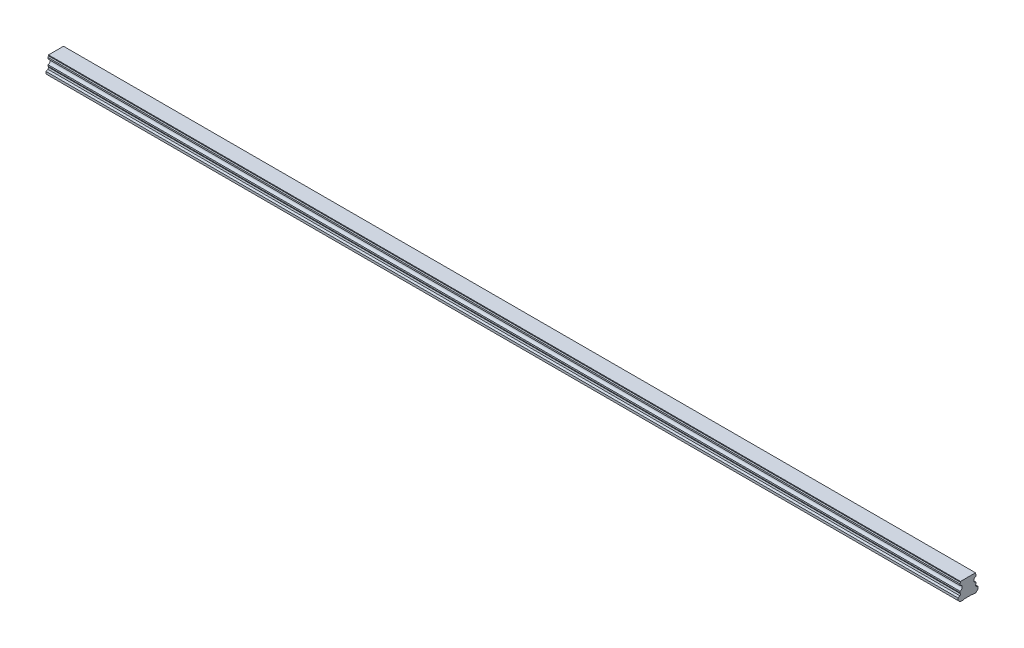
ISO-10303-21;
HEADER;
FILE_DESCRIPTION(('STEP AP214'),'2;1');
FILE_NAME('part.step','',(''),(''),'','','');
FILE_SCHEMA(('AUTOMOTIVE_DESIGN { 1 0 10303 214 1 1 1 1 }'));
ENDSEC;
DATA;
#1=APPLICATION_CONTEXT('core data for automotive mechanical design processes');
#2=APPLICATION_PROTOCOL_DEFINITION('international standard','automotive_design',2000,#1);
#3=PRODUCT_CONTEXT('',#1,'mechanical');
#4=PRODUCT('Part','Part','',(#3));
#5=PRODUCT_RELATED_PRODUCT_CATEGORY('part','',(#4));
#6=PRODUCT_DEFINITION_FORMATION('','',#4);
#7=PRODUCT_DEFINITION_CONTEXT('part definition',#1,'design');
#8=PRODUCT_DEFINITION('design','',#6,#7);
#9=PRODUCT_DEFINITION_SHAPE('','',#8);
#10=(LENGTH_UNIT() NAMED_UNIT(*) SI_UNIT(.MILLI.,.METRE.));
#11=(NAMED_UNIT(*) PLANE_ANGLE_UNIT() SI_UNIT($,.RADIAN.));
#12=(NAMED_UNIT(*) SI_UNIT($,.STERADIAN.) SOLID_ANGLE_UNIT());
#13=UNCERTAINTY_MEASURE_WITH_UNIT(LENGTH_MEASURE(1.E-05),#10,'distance_accuracy_value','');
#14=(GEOMETRIC_REPRESENTATION_CONTEXT(3) GLOBAL_UNCERTAINTY_ASSIGNED_CONTEXT((#13)) GLOBAL_UNIT_ASSIGNED_CONTEXT((#10,
#11,#12)) REPRESENTATION_CONTEXT('',''));
#15=CARTESIAN_POINT('',(0.,0.,0.));
#16=DIRECTION('',(0.,0.,1.));
#17=DIRECTION('',(1.,0.,0.));
#18=AXIS2_PLACEMENT_3D('',#15,#16,#17);
#19=CARTESIAN_POINT('',(1110.,0.499999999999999,0.));
#20=DIRECTION('',(0.,-1.,0.));
#21=DIRECTION('',(0.,0.,-1.));
#22=AXIS2_PLACEMENT_3D('',#19,#20,#21);
#23=CONICAL_SURFACE('',#22,3.5,0.785398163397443);
#24=CARTESIAN_POINT('',(1110.,1.00000000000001,0.));
#25=DIRECTION('',(0.,1.,0.));
#26=DIRECTION('',(0.,0.,1.));
#27=AXIS2_PLACEMENT_3D('',#24,#25,#26);
#28=CIRCLE('',#27,3.);
#29=CARTESIAN_POINT('',(1110.,1.00000000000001,3.));
#30=VERTEX_POINT('',#29);
#31=EDGE_CURVE('E11',#30,#30,#28,.F.);
#32=ORIENTED_EDGE('',*,*,#31,.F.);
#33=EDGE_LOOP('',(#32));
#34=FACE_BOUND('',#33,.T.);
#35=CARTESIAN_POINT('',(1110.,0.499999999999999,0.));
#36=DIRECTION('',(0.,1.,0.));
#37=DIRECTION('',(0.,0.,1.));
#38=AXIS2_PLACEMENT_3D('',#35,#36,#37);
#39=CIRCLE('',#38,3.5);
#40=CARTESIAN_POINT('',(1110.,0.5,3.5));
#41=VERTEX_POINT('',#40);
#42=EDGE_CURVE('E626',#41,#41,#39,.T.);
#43=ORIENTED_EDGE('',*,*,#42,.F.);
#44=EDGE_LOOP('',(#43));
#45=FACE_BOUND('',#44,.T.);
#46=ADVANCED_FACE('F39',(#34,#45),#23,.F.);
#47=CARTESIAN_POINT('',(1110.,12.,0.));
#48=DIRECTION('',(0.,-1.,0.));
#49=DIRECTION('',(0.,0.,-1.));
#50=AXIS2_PLACEMENT_3D('',#47,#48,#49);
#51=CYLINDRICAL_SURFACE('',#50,3.);
#52=ORIENTED_EDGE('',*,*,#31,.T.);
#53=EDGE_LOOP('',(#52));
#54=FACE_BOUND('',#53,.T.);
#55=CARTESIAN_POINT('',(1110.,12.,0.));
#56=DIRECTION('',(0.,-1.,0.));
#57=DIRECTION('',(0.,0.,-1.));
#58=AXIS2_PLACEMENT_3D('',#55,#56,#57);
#59=CIRCLE('',#58,3.);
#60=CARTESIAN_POINT('',(1110.,12.,-3.));
#61=VERTEX_POINT('',#60);
#62=EDGE_CURVE('E49',#61,#61,#59,.T.);
#63=ORIENTED_EDGE('',*,*,#62,.F.);
#64=EDGE_LOOP('',(#63));
#65=FACE_BOUND('',#64,.T.);
#66=ADVANCED_FACE('F892',(#54,#65),#51,.F.);
#67=CARTESIAN_POINT('',(1110.,12.,0.));
#68=DIRECTION('',(0.,-1.,0.));
#69=DIRECTION('',(0.,0.,-1.));
#70=AXIS2_PLACEMENT_3D('',#67,#68,#69);
#71=PLANE('',#70);
#72=CARTESIAN_POINT('',(1110.,12.,0.));
#73=DIRECTION('',(0.,-1.,0.));
#74=DIRECTION('',(0.,0.,-1.));
#75=AXIS2_PLACEMENT_3D('',#72,#73,#74);
#76=CIRCLE('',#75,2.5);
#77=CARTESIAN_POINT('',(1110.,12.,-2.5));
#78=VERTEX_POINT('',#77);
#79=EDGE_CURVE('E42',#78,#78,#76,.T.);
#80=ORIENTED_EDGE('',*,*,#79,.F.);
#81=EDGE_LOOP('',(#80));
#82=FACE_BOUND('',#81,.T.);
#83=ORIENTED_EDGE('',*,*,#62,.T.);
#84=EDGE_LOOP('',(#83));
#85=FACE_BOUND('',#84,.T.);
#86=ADVANCED_FACE('F897',(#82,#85),#71,.T.);
#87=CARTESIAN_POINT('',(1050.,0.499999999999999,0.));
#88=DIRECTION('',(0.,-1.,0.));
#89=DIRECTION('',(0.,0.,-1.));
#90=AXIS2_PLACEMENT_3D('',#87,#88,#89);
#91=CONICAL_SURFACE('',#90,3.5,0.785398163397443);
#92=CARTESIAN_POINT('',(1050.,1.00000000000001,0.));
#93=DIRECTION('',(0.,1.,0.));
#94=DIRECTION('',(0.,0.,1.));
#95=AXIS2_PLACEMENT_3D('',#92,#93,#94);
#96=CIRCLE('',#95,3.);
#97=CARTESIAN_POINT('',(1050.,1.00000000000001,3.));
#98=VERTEX_POINT('',#97);
#99=EDGE_CURVE('E622',#98,#98,#96,.F.);
#100=ORIENTED_EDGE('',*,*,#99,.F.);
#101=EDGE_LOOP('',(#100));
#102=FACE_BOUND('',#101,.T.);
#103=CARTESIAN_POINT('',(1050.,0.499999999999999,0.));
#104=DIRECTION('',(0.,1.,0.));
#105=DIRECTION('',(0.,0.,1.));
#106=AXIS2_PLACEMENT_3D('',#103,#104,#105);
#107=CIRCLE('',#106,3.5);
#108=CARTESIAN_POINT('',(1050.,0.5,3.5));
#109=VERTEX_POINT('',#108);
#110=EDGE_CURVE('E614',#109,#109,#107,.T.);
#111=ORIENTED_EDGE('',*,*,#110,.F.);
#112=EDGE_LOOP('',(#111));
#113=FACE_BOUND('',#112,.T.);
#114=ADVANCED_FACE('F1164',(#102,#113),#91,.F.);
#115=CARTESIAN_POINT('',(1050.,12.,0.));
#116=DIRECTION('',(0.,-1.,0.));
#117=DIRECTION('',(0.,0.,-1.));
#118=AXIS2_PLACEMENT_3D('',#115,#116,#117);
#119=CYLINDRICAL_SURFACE('',#118,3.);
#120=ORIENTED_EDGE('',*,*,#99,.T.);
#121=EDGE_LOOP('',(#120));
#122=FACE_BOUND('',#121,.T.);
#123=CARTESIAN_POINT('',(1050.,12.,0.));
#124=DIRECTION('',(0.,-1.,0.));
#125=DIRECTION('',(0.,0.,-1.));
#126=AXIS2_PLACEMENT_3D('',#123,#124,#125);
#127=CIRCLE('',#126,3.);
#128=CARTESIAN_POINT('',(1050.,12.,-3.));
#129=VERTEX_POINT('',#128);
#130=EDGE_CURVE('E618',#129,#129,#127,.T.);
#131=ORIENTED_EDGE('',*,*,#130,.F.);
#132=EDGE_LOOP('',(#131));
#133=FACE_BOUND('',#132,.T.);
#134=ADVANCED_FACE('F1160',(#122,#133),#119,.F.);
#135=CARTESIAN_POINT('',(1050.,12.,0.));
#136=DIRECTION('',(0.,-1.,0.));
#137=DIRECTION('',(0.,0.,-1.));
#138=AXIS2_PLACEMENT_3D('',#135,#136,#137);
#139=PLANE('',#138);
#140=CARTESIAN_POINT('',(1050.,12.,0.));
#141=DIRECTION('',(0.,-1.,0.));
#142=DIRECTION('',(0.,0.,-1.));
#143=AXIS2_PLACEMENT_3D('',#140,#141,#142);
#144=CIRCLE('',#143,2.5);
#145=CARTESIAN_POINT('',(1050.,12.,-2.5));
#146=VERTEX_POINT('',#145);
#147=EDGE_CURVE('E697',#146,#146,#144,.T.);
#148=ORIENTED_EDGE('',*,*,#147,.F.);
#149=EDGE_LOOP('',(#148));
#150=FACE_BOUND('',#149,.T.);
#151=ORIENTED_EDGE('',*,*,#130,.T.);
#152=EDGE_LOOP('',(#151));
#153=FACE_BOUND('',#152,.T.);
#154=ADVANCED_FACE('F1156',(#150,#153),#139,.T.);
#155=CARTESIAN_POINT('',(990.,0.499999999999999,0.));
#156=DIRECTION('',(0.,-1.,0.));
#157=DIRECTION('',(0.,0.,-1.));
#158=AXIS2_PLACEMENT_3D('',#155,#156,#157);
#159=CONICAL_SURFACE('',#158,3.5,0.785398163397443);
#160=CARTESIAN_POINT('',(990.,1.00000000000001,0.));
#161=DIRECTION('',(0.,1.,0.));
#162=DIRECTION('',(0.,0.,1.));
#163=AXIS2_PLACEMENT_3D('',#160,#161,#162);
#164=CIRCLE('',#163,3.);
#165=CARTESIAN_POINT('',(990.,1.00000000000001,3.));
#166=VERTEX_POINT('',#165);
#167=EDGE_CURVE('E610',#166,#166,#164,.F.);
#168=ORIENTED_EDGE('',*,*,#167,.F.);
#169=EDGE_LOOP('',(#168));
#170=FACE_BOUND('',#169,.T.);
#171=CARTESIAN_POINT('',(990.,0.499999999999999,0.));
#172=DIRECTION('',(0.,1.,0.));
#173=DIRECTION('',(0.,0.,1.));
#174=AXIS2_PLACEMENT_3D('',#171,#172,#173);
#175=CIRCLE('',#174,3.5);
#176=CARTESIAN_POINT('',(990.,0.5,3.5));
#177=VERTEX_POINT('',#176);
#178=EDGE_CURVE('E602',#177,#177,#175,.T.);
#179=ORIENTED_EDGE('',*,*,#178,.F.);
#180=EDGE_LOOP('',(#179));
#181=FACE_BOUND('',#180,.T.);
#182=ADVANCED_FACE('F1152',(#170,#181),#159,.F.);
#183=CARTESIAN_POINT('',(990.,12.,0.));
#184=DIRECTION('',(0.,-1.,0.));
#185=DIRECTION('',(0.,0.,-1.));
#186=AXIS2_PLACEMENT_3D('',#183,#184,#185);
#187=CYLINDRICAL_SURFACE('',#186,3.);
#188=ORIENTED_EDGE('',*,*,#167,.T.);
#189=EDGE_LOOP('',(#188));
#190=FACE_BOUND('',#189,.T.);
#191=CARTESIAN_POINT('',(990.,12.,0.));
#192=DIRECTION('',(0.,-1.,0.));
#193=DIRECTION('',(0.,0.,-1.));
#194=AXIS2_PLACEMENT_3D('',#191,#192,#193);
#195=CIRCLE('',#194,3.);
#196=CARTESIAN_POINT('',(990.,12.,-3.));
#197=VERTEX_POINT('',#196);
#198=EDGE_CURVE('E606',#197,#197,#195,.T.);
#199=ORIENTED_EDGE('',*,*,#198,.F.);
#200=EDGE_LOOP('',(#199));
#201=FACE_BOUND('',#200,.T.);
#202=ADVANCED_FACE('F1148',(#190,#201),#187,.F.);
#203=CARTESIAN_POINT('',(990.,12.,0.));
#204=DIRECTION('',(0.,-1.,0.));
#205=DIRECTION('',(0.,0.,-1.));
#206=AXIS2_PLACEMENT_3D('',#203,#204,#205);
#207=PLANE('',#206);
#208=CARTESIAN_POINT('',(990.,12.,0.));
#209=DIRECTION('',(0.,-1.,0.));
#210=DIRECTION('',(0.,0.,-1.));
#211=AXIS2_PLACEMENT_3D('',#208,#209,#210);
#212=CIRCLE('',#211,2.5);
#213=CARTESIAN_POINT('',(990.,12.,-2.5));
#214=VERTEX_POINT('',#213);
#215=EDGE_CURVE('E694',#214,#214,#212,.T.);
#216=ORIENTED_EDGE('',*,*,#215,.F.);
#217=EDGE_LOOP('',(#216));
#218=FACE_BOUND('',#217,.T.);
#219=ORIENTED_EDGE('',*,*,#198,.T.);
#220=EDGE_LOOP('',(#219));
#221=FACE_BOUND('',#220,.T.);
#222=ADVANCED_FACE('F1144',(#218,#221),#207,.T.);
#223=CARTESIAN_POINT('',(930.,0.499999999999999,0.));
#224=DIRECTION('',(0.,-1.,0.));
#225=DIRECTION('',(0.,0.,-1.));
#226=AXIS2_PLACEMENT_3D('',#223,#224,#225);
#227=CONICAL_SURFACE('',#226,3.5,0.785398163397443);
#228=CARTESIAN_POINT('',(930.,1.00000000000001,0.));
#229=DIRECTION('',(0.,1.,0.));
#230=DIRECTION('',(0.,0.,1.));
#231=AXIS2_PLACEMENT_3D('',#228,#229,#230);
#232=CIRCLE('',#231,3.);
#233=CARTESIAN_POINT('',(930.,1.00000000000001,3.));
#234=VERTEX_POINT('',#233);
#235=EDGE_CURVE('E598',#234,#234,#232,.F.);
#236=ORIENTED_EDGE('',*,*,#235,.F.);
#237=EDGE_LOOP('',(#236));
#238=FACE_BOUND('',#237,.T.);
#239=CARTESIAN_POINT('',(930.,0.499999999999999,0.));
#240=DIRECTION('',(0.,1.,0.));
#241=DIRECTION('',(0.,0.,1.));
#242=AXIS2_PLACEMENT_3D('',#239,#240,#241);
#243=CIRCLE('',#242,3.5);
#244=CARTESIAN_POINT('',(930.,0.5,3.5));
#245=VERTEX_POINT('',#244);
#246=EDGE_CURVE('E590',#245,#245,#243,.T.);
#247=ORIENTED_EDGE('',*,*,#246,.F.);
#248=EDGE_LOOP('',(#247));
#249=FACE_BOUND('',#248,.T.);
#250=ADVANCED_FACE('F1140',(#238,#249),#227,.F.);
#251=CARTESIAN_POINT('',(930.,12.,0.));
#252=DIRECTION('',(0.,-1.,0.));
#253=DIRECTION('',(0.,0.,-1.));
#254=AXIS2_PLACEMENT_3D('',#251,#252,#253);
#255=CYLINDRICAL_SURFACE('',#254,3.);
#256=ORIENTED_EDGE('',*,*,#235,.T.);
#257=EDGE_LOOP('',(#256));
#258=FACE_BOUND('',#257,.T.);
#259=CARTESIAN_POINT('',(930.,12.,0.));
#260=DIRECTION('',(0.,-1.,0.));
#261=DIRECTION('',(0.,0.,-1.));
#262=AXIS2_PLACEMENT_3D('',#259,#260,#261);
#263=CIRCLE('',#262,3.);
#264=CARTESIAN_POINT('',(930.,12.,-3.));
#265=VERTEX_POINT('',#264);
#266=EDGE_CURVE('E594',#265,#265,#263,.T.);
#267=ORIENTED_EDGE('',*,*,#266,.F.);
#268=EDGE_LOOP('',(#267));
#269=FACE_BOUND('',#268,.T.);
#270=ADVANCED_FACE('F1136',(#258,#269),#255,.F.);
#271=CARTESIAN_POINT('',(930.,12.,0.));
#272=DIRECTION('',(0.,-1.,0.));
#273=DIRECTION('',(0.,0.,-1.));
#274=AXIS2_PLACEMENT_3D('',#271,#272,#273);
#275=PLANE('',#274);
#276=CARTESIAN_POINT('',(930.,12.,0.));
#277=DIRECTION('',(0.,-1.,0.));
#278=DIRECTION('',(0.,0.,-1.));
#279=AXIS2_PLACEMENT_3D('',#276,#277,#278);
#280=CIRCLE('',#279,2.5);
#281=CARTESIAN_POINT('',(930.,12.,-2.5));
#282=VERTEX_POINT('',#281);
#283=EDGE_CURVE('E690',#282,#282,#280,.T.);
#284=ORIENTED_EDGE('',*,*,#283,.F.);
#285=EDGE_LOOP('',(#284));
#286=FACE_BOUND('',#285,.T.);
#287=ORIENTED_EDGE('',*,*,#266,.T.);
#288=EDGE_LOOP('',(#287));
#289=FACE_BOUND('',#288,.T.);
#290=ADVANCED_FACE('F1132',(#286,#289),#275,.T.);
#291=CARTESIAN_POINT('',(870.,0.499999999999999,0.));
#292=DIRECTION('',(0.,-1.,0.));
#293=DIRECTION('',(0.,0.,-1.));
#294=AXIS2_PLACEMENT_3D('',#291,#292,#293);
#295=CONICAL_SURFACE('',#294,3.5,0.785398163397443);
#296=CARTESIAN_POINT('',(870.,1.00000000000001,0.));
#297=DIRECTION('',(0.,1.,0.));
#298=DIRECTION('',(0.,0.,1.));
#299=AXIS2_PLACEMENT_3D('',#296,#297,#298);
#300=CIRCLE('',#299,3.);
#301=CARTESIAN_POINT('',(870.,1.00000000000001,3.));
#302=VERTEX_POINT('',#301);
#303=EDGE_CURVE('E586',#302,#302,#300,.F.);
#304=ORIENTED_EDGE('',*,*,#303,.F.);
#305=EDGE_LOOP('',(#304));
#306=FACE_BOUND('',#305,.T.);
#307=CARTESIAN_POINT('',(870.,0.499999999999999,0.));
#308=DIRECTION('',(0.,1.,0.));
#309=DIRECTION('',(0.,0.,1.));
#310=AXIS2_PLACEMENT_3D('',#307,#308,#309);
#311=CIRCLE('',#310,3.5);
#312=CARTESIAN_POINT('',(870.,0.5,3.5));
#313=VERTEX_POINT('',#312);
#314=EDGE_CURVE('E578',#313,#313,#311,.T.);
#315=ORIENTED_EDGE('',*,*,#314,.F.);
#316=EDGE_LOOP('',(#315));
#317=FACE_BOUND('',#316,.T.);
#318=ADVANCED_FACE('F1128',(#306,#317),#295,.F.);
#319=CARTESIAN_POINT('',(870.,12.,0.));
#320=DIRECTION('',(0.,-1.,0.));
#321=DIRECTION('',(0.,0.,-1.));
#322=AXIS2_PLACEMENT_3D('',#319,#320,#321);
#323=CYLINDRICAL_SURFACE('',#322,3.);
#324=ORIENTED_EDGE('',*,*,#303,.T.);
#325=EDGE_LOOP('',(#324));
#326=FACE_BOUND('',#325,.T.);
#327=CARTESIAN_POINT('',(870.,12.,0.));
#328=DIRECTION('',(0.,-1.,0.));
#329=DIRECTION('',(0.,0.,-1.));
#330=AXIS2_PLACEMENT_3D('',#327,#328,#329);
#331=CIRCLE('',#330,3.);
#332=CARTESIAN_POINT('',(870.,12.,-3.));
#333=VERTEX_POINT('',#332);
#334=EDGE_CURVE('E582',#333,#333,#331,.T.);
#335=ORIENTED_EDGE('',*,*,#334,.F.);
#336=EDGE_LOOP('',(#335));
#337=FACE_BOUND('',#336,.T.);
#338=ADVANCED_FACE('F1124',(#326,#337),#323,.F.);
#339=CARTESIAN_POINT('',(870.,12.,0.));
#340=DIRECTION('',(0.,-1.,0.));
#341=DIRECTION('',(0.,0.,-1.));
#342=AXIS2_PLACEMENT_3D('',#339,#340,#341);
#343=PLANE('',#342);
#344=CARTESIAN_POINT('',(870.,12.,0.));
#345=DIRECTION('',(0.,-1.,0.));
#346=DIRECTION('',(0.,0.,-1.));
#347=AXIS2_PLACEMENT_3D('',#344,#345,#346);
#348=CIRCLE('',#347,2.5);
#349=CARTESIAN_POINT('',(870.,12.,-2.5));
#350=VERTEX_POINT('',#349);
#351=EDGE_CURVE('E686',#350,#350,#348,.T.);
#352=ORIENTED_EDGE('',*,*,#351,.F.);
#353=EDGE_LOOP('',(#352));
#354=FACE_BOUND('',#353,.T.);
#355=ORIENTED_EDGE('',*,*,#334,.T.);
#356=EDGE_LOOP('',(#355));
#357=FACE_BOUND('',#356,.T.);
#358=ADVANCED_FACE('F1120',(#354,#357),#343,.T.);
#359=CARTESIAN_POINT('',(810.,0.499999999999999,0.));
#360=DIRECTION('',(0.,-1.,0.));
#361=DIRECTION('',(0.,0.,-1.));
#362=AXIS2_PLACEMENT_3D('',#359,#360,#361);
#363=CONICAL_SURFACE('',#362,3.5,0.785398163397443);
#364=CARTESIAN_POINT('',(810.,1.00000000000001,0.));
#365=DIRECTION('',(0.,1.,0.));
#366=DIRECTION('',(0.,0.,1.));
#367=AXIS2_PLACEMENT_3D('',#364,#365,#366);
#368=CIRCLE('',#367,3.);
#369=CARTESIAN_POINT('',(810.,1.00000000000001,3.));
#370=VERTEX_POINT('',#369);
#371=EDGE_CURVE('E574',#370,#370,#368,.F.);
#372=ORIENTED_EDGE('',*,*,#371,.F.);
#373=EDGE_LOOP('',(#372));
#374=FACE_BOUND('',#373,.T.);
#375=CARTESIAN_POINT('',(810.,0.499999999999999,0.));
#376=DIRECTION('',(0.,1.,0.));
#377=DIRECTION('',(0.,0.,1.));
#378=AXIS2_PLACEMENT_3D('',#375,#376,#377);
#379=CIRCLE('',#378,3.5);
#380=CARTESIAN_POINT('',(810.,0.5,3.5));
#381=VERTEX_POINT('',#380);
#382=EDGE_CURVE('E566',#381,#381,#379,.T.);
#383=ORIENTED_EDGE('',*,*,#382,.F.);
#384=EDGE_LOOP('',(#383));
#385=FACE_BOUND('',#384,.T.);
#386=ADVANCED_FACE('F1116',(#374,#385),#363,.F.);
#387=CARTESIAN_POINT('',(810.,12.,0.));
#388=DIRECTION('',(0.,-1.,0.));
#389=DIRECTION('',(0.,0.,-1.));
#390=AXIS2_PLACEMENT_3D('',#387,#388,#389);
#391=CYLINDRICAL_SURFACE('',#390,3.);
#392=ORIENTED_EDGE('',*,*,#371,.T.);
#393=EDGE_LOOP('',(#392));
#394=FACE_BOUND('',#393,.T.);
#395=CARTESIAN_POINT('',(810.,12.,0.));
#396=DIRECTION('',(0.,-1.,0.));
#397=DIRECTION('',(0.,0.,-1.));
#398=AXIS2_PLACEMENT_3D('',#395,#396,#397);
#399=CIRCLE('',#398,3.);
#400=CARTESIAN_POINT('',(810.,12.,-3.));
#401=VERTEX_POINT('',#400);
#402=EDGE_CURVE('E570',#401,#401,#399,.T.);
#403=ORIENTED_EDGE('',*,*,#402,.F.);
#404=EDGE_LOOP('',(#403));
#405=FACE_BOUND('',#404,.T.);
#406=ADVANCED_FACE('F1112',(#394,#405),#391,.F.);
#407=CARTESIAN_POINT('',(810.,12.,0.));
#408=DIRECTION('',(0.,-1.,0.));
#409=DIRECTION('',(0.,0.,-1.));
#410=AXIS2_PLACEMENT_3D('',#407,#408,#409);
#411=PLANE('',#410);
#412=CARTESIAN_POINT('',(810.,12.,0.));
#413=DIRECTION('',(0.,-1.,0.));
#414=DIRECTION('',(0.,0.,-1.));
#415=AXIS2_PLACEMENT_3D('',#412,#413,#414);
#416=CIRCLE('',#415,2.5);
#417=CARTESIAN_POINT('',(810.,12.,-2.5));
#418=VERTEX_POINT('',#417);
#419=EDGE_CURVE('E682',#418,#418,#416,.T.);
#420=ORIENTED_EDGE('',*,*,#419,.F.);
#421=EDGE_LOOP('',(#420));
#422=FACE_BOUND('',#421,.T.);
#423=ORIENTED_EDGE('',*,*,#402,.T.);
#424=EDGE_LOOP('',(#423));
#425=FACE_BOUND('',#424,.T.);
#426=ADVANCED_FACE('F1108',(#422,#425),#411,.T.);
#427=CARTESIAN_POINT('',(750.,0.499999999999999,0.));
#428=DIRECTION('',(0.,-1.,0.));
#429=DIRECTION('',(0.,0.,-1.));
#430=AXIS2_PLACEMENT_3D('',#427,#428,#429);
#431=CONICAL_SURFACE('',#430,3.5,0.785398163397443);
#432=CARTESIAN_POINT('',(750.,1.00000000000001,0.));
#433=DIRECTION('',(0.,1.,0.));
#434=DIRECTION('',(0.,0.,1.));
#435=AXIS2_PLACEMENT_3D('',#432,#433,#434);
#436=CIRCLE('',#435,3.);
#437=CARTESIAN_POINT('',(750.,1.00000000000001,3.));
#438=VERTEX_POINT('',#437);
#439=EDGE_CURVE('E562',#438,#438,#436,.F.);
#440=ORIENTED_EDGE('',*,*,#439,.F.);
#441=EDGE_LOOP('',(#440));
#442=FACE_BOUND('',#441,.T.);
#443=CARTESIAN_POINT('',(750.,0.499999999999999,0.));
#444=DIRECTION('',(0.,1.,0.));
#445=DIRECTION('',(0.,0.,1.));
#446=AXIS2_PLACEMENT_3D('',#443,#444,#445);
#447=CIRCLE('',#446,3.5);
#448=CARTESIAN_POINT('',(750.,0.5,3.5));
#449=VERTEX_POINT('',#448);
#450=EDGE_CURVE('E554',#449,#449,#447,.T.);
#451=ORIENTED_EDGE('',*,*,#450,.F.);
#452=EDGE_LOOP('',(#451));
#453=FACE_BOUND('',#452,.T.);
#454=ADVANCED_FACE('F1104',(#442,#453),#431,.F.);
#455=CARTESIAN_POINT('',(750.,12.,0.));
#456=DIRECTION('',(0.,-1.,0.));
#457=DIRECTION('',(0.,0.,-1.));
#458=AXIS2_PLACEMENT_3D('',#455,#456,#457);
#459=CYLINDRICAL_SURFACE('',#458,3.);
#460=ORIENTED_EDGE('',*,*,#439,.T.);
#461=EDGE_LOOP('',(#460));
#462=FACE_BOUND('',#461,.T.);
#463=CARTESIAN_POINT('',(750.,12.,0.));
#464=DIRECTION('',(0.,-1.,0.));
#465=DIRECTION('',(0.,0.,-1.));
#466=AXIS2_PLACEMENT_3D('',#463,#464,#465);
#467=CIRCLE('',#466,3.);
#468=CARTESIAN_POINT('',(750.,12.,-3.));
#469=VERTEX_POINT('',#468);
#470=EDGE_CURVE('E558',#469,#469,#467,.T.);
#471=ORIENTED_EDGE('',*,*,#470,.F.);
#472=EDGE_LOOP('',(#471));
#473=FACE_BOUND('',#472,.T.);
#474=ADVANCED_FACE('F1100',(#462,#473),#459,.F.);
#475=CARTESIAN_POINT('',(750.,12.,0.));
#476=DIRECTION('',(0.,-1.,0.));
#477=DIRECTION('',(0.,0.,-1.));
#478=AXIS2_PLACEMENT_3D('',#475,#476,#477);
#479=PLANE('',#478);
#480=CARTESIAN_POINT('',(750.,12.,0.));
#481=DIRECTION('',(0.,-1.,0.));
#482=DIRECTION('',(0.,0.,-1.));
#483=AXIS2_PLACEMENT_3D('',#480,#481,#482);
#484=CIRCLE('',#483,2.5);
#485=CARTESIAN_POINT('',(750.,12.,-2.5));
#486=VERTEX_POINT('',#485);
#487=EDGE_CURVE('E678',#486,#486,#484,.T.);
#488=ORIENTED_EDGE('',*,*,#487,.F.);
#489=EDGE_LOOP('',(#488));
#490=FACE_BOUND('',#489,.T.);
#491=ORIENTED_EDGE('',*,*,#470,.T.);
#492=EDGE_LOOP('',(#491));
#493=FACE_BOUND('',#492,.T.);
#494=ADVANCED_FACE('F1096',(#490,#493),#479,.T.);
#495=CARTESIAN_POINT('',(690.,0.499999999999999,0.));
#496=DIRECTION('',(0.,-1.,0.));
#497=DIRECTION('',(0.,0.,-1.));
#498=AXIS2_PLACEMENT_3D('',#495,#496,#497);
#499=CONICAL_SURFACE('',#498,3.5,0.785398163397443);
#500=CARTESIAN_POINT('',(690.,1.00000000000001,0.));
#501=DIRECTION('',(0.,1.,0.));
#502=DIRECTION('',(0.,0.,1.));
#503=AXIS2_PLACEMENT_3D('',#500,#501,#502);
#504=CIRCLE('',#503,3.);
#505=CARTESIAN_POINT('',(690.,1.00000000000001,3.));
#506=VERTEX_POINT('',#505);
#507=EDGE_CURVE('E550',#506,#506,#504,.F.);
#508=ORIENTED_EDGE('',*,*,#507,.F.);
#509=EDGE_LOOP('',(#508));
#510=FACE_BOUND('',#509,.T.);
#511=CARTESIAN_POINT('',(690.,0.499999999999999,0.));
#512=DIRECTION('',(0.,1.,0.));
#513=DIRECTION('',(0.,0.,1.));
#514=AXIS2_PLACEMENT_3D('',#511,#512,#513);
#515=CIRCLE('',#514,3.5);
#516=CARTESIAN_POINT('',(690.,0.5,3.5));
#517=VERTEX_POINT('',#516);
#518=EDGE_CURVE('E542',#517,#517,#515,.T.);
#519=ORIENTED_EDGE('',*,*,#518,.F.);
#520=EDGE_LOOP('',(#519));
#521=FACE_BOUND('',#520,.T.);
#522=ADVANCED_FACE('F1092',(#510,#521),#499,.F.);
#523=CARTESIAN_POINT('',(690.,12.,0.));
#524=DIRECTION('',(0.,-1.,0.));
#525=DIRECTION('',(0.,0.,-1.));
#526=AXIS2_PLACEMENT_3D('',#523,#524,#525);
#527=CYLINDRICAL_SURFACE('',#526,3.);
#528=ORIENTED_EDGE('',*,*,#507,.T.);
#529=EDGE_LOOP('',(#528));
#530=FACE_BOUND('',#529,.T.);
#531=CARTESIAN_POINT('',(690.,12.,0.));
#532=DIRECTION('',(0.,-1.,0.));
#533=DIRECTION('',(0.,0.,-1.));
#534=AXIS2_PLACEMENT_3D('',#531,#532,#533);
#535=CIRCLE('',#534,3.);
#536=CARTESIAN_POINT('',(690.,12.,-3.));
#537=VERTEX_POINT('',#536);
#538=EDGE_CURVE('E546',#537,#537,#535,.T.);
#539=ORIENTED_EDGE('',*,*,#538,.F.);
#540=EDGE_LOOP('',(#539));
#541=FACE_BOUND('',#540,.T.);
#542=ADVANCED_FACE('F1088',(#530,#541),#527,.F.);
#543=CARTESIAN_POINT('',(690.,12.,0.));
#544=DIRECTION('',(0.,-1.,0.));
#545=DIRECTION('',(0.,0.,-1.));
#546=AXIS2_PLACEMENT_3D('',#543,#544,#545);
#547=PLANE('',#546);
#548=CARTESIAN_POINT('',(690.,12.,0.));
#549=DIRECTION('',(0.,-1.,0.));
#550=DIRECTION('',(0.,0.,-1.));
#551=AXIS2_PLACEMENT_3D('',#548,#549,#550);
#552=CIRCLE('',#551,2.5);
#553=CARTESIAN_POINT('',(690.,12.,-2.5));
#554=VERTEX_POINT('',#553);
#555=EDGE_CURVE('E674',#554,#554,#552,.T.);
#556=ORIENTED_EDGE('',*,*,#555,.F.);
#557=EDGE_LOOP('',(#556));
#558=FACE_BOUND('',#557,.T.);
#559=ORIENTED_EDGE('',*,*,#538,.T.);
#560=EDGE_LOOP('',(#559));
#561=FACE_BOUND('',#560,.T.);
#562=ADVANCED_FACE('F1084',(#558,#561),#547,.T.);
#563=CARTESIAN_POINT('',(630.,0.499999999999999,0.));
#564=DIRECTION('',(0.,-1.,0.));
#565=DIRECTION('',(0.,0.,-1.));
#566=AXIS2_PLACEMENT_3D('',#563,#564,#565);
#567=CONICAL_SURFACE('',#566,3.5,0.785398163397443);
#568=CARTESIAN_POINT('',(630.,1.00000000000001,0.));
#569=DIRECTION('',(0.,1.,0.));
#570=DIRECTION('',(0.,0.,1.));
#571=AXIS2_PLACEMENT_3D('',#568,#569,#570);
#572=CIRCLE('',#571,3.);
#573=CARTESIAN_POINT('',(630.,1.00000000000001,3.));
#574=VERTEX_POINT('',#573);
#575=EDGE_CURVE('E538',#574,#574,#572,.F.);
#576=ORIENTED_EDGE('',*,*,#575,.F.);
#577=EDGE_LOOP('',(#576));
#578=FACE_BOUND('',#577,.T.);
#579=CARTESIAN_POINT('',(630.,0.499999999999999,0.));
#580=DIRECTION('',(0.,1.,0.));
#581=DIRECTION('',(0.,0.,1.));
#582=AXIS2_PLACEMENT_3D('',#579,#580,#581);
#583=CIRCLE('',#582,3.5);
#584=CARTESIAN_POINT('',(630.,0.5,3.5));
#585=VERTEX_POINT('',#584);
#586=EDGE_CURVE('E530',#585,#585,#583,.T.);
#587=ORIENTED_EDGE('',*,*,#586,.F.);
#588=EDGE_LOOP('',(#587));
#589=FACE_BOUND('',#588,.T.);
#590=ADVANCED_FACE('F1080',(#578,#589),#567,.F.);
#591=CARTESIAN_POINT('',(630.,12.,0.));
#592=DIRECTION('',(0.,-1.,0.));
#593=DIRECTION('',(0.,0.,-1.));
#594=AXIS2_PLACEMENT_3D('',#591,#592,#593);
#595=CYLINDRICAL_SURFACE('',#594,3.);
#596=ORIENTED_EDGE('',*,*,#575,.T.);
#597=EDGE_LOOP('',(#596));
#598=FACE_BOUND('',#597,.T.);
#599=CARTESIAN_POINT('',(630.,12.,0.));
#600=DIRECTION('',(0.,-1.,0.));
#601=DIRECTION('',(0.,0.,-1.));
#602=AXIS2_PLACEMENT_3D('',#599,#600,#601);
#603=CIRCLE('',#602,3.);
#604=CARTESIAN_POINT('',(630.,12.,-3.));
#605=VERTEX_POINT('',#604);
#606=EDGE_CURVE('E534',#605,#605,#603,.T.);
#607=ORIENTED_EDGE('',*,*,#606,.F.);
#608=EDGE_LOOP('',(#607));
#609=FACE_BOUND('',#608,.T.);
#610=ADVANCED_FACE('F1076',(#598,#609),#595,.F.);
#611=CARTESIAN_POINT('',(630.,12.,0.));
#612=DIRECTION('',(0.,-1.,0.));
#613=DIRECTION('',(0.,0.,-1.));
#614=AXIS2_PLACEMENT_3D('',#611,#612,#613);
#615=PLANE('',#614);
#616=CARTESIAN_POINT('',(630.,12.,0.));
#617=DIRECTION('',(0.,-1.,0.));
#618=DIRECTION('',(0.,0.,-1.));
#619=AXIS2_PLACEMENT_3D('',#616,#617,#618);
#620=CIRCLE('',#619,2.5);
#621=CARTESIAN_POINT('',(630.,12.,-2.5));
#622=VERTEX_POINT('',#621);
#623=EDGE_CURVE('E670',#622,#622,#620,.T.);
#624=ORIENTED_EDGE('',*,*,#623,.F.);
#625=EDGE_LOOP('',(#624));
#626=FACE_BOUND('',#625,.T.);
#627=ORIENTED_EDGE('',*,*,#606,.T.);
#628=EDGE_LOOP('',(#627));
#629=FACE_BOUND('',#628,.T.);
#630=ADVANCED_FACE('F1072',(#626,#629),#615,.T.);
#631=CARTESIAN_POINT('',(570.,0.499999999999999,0.));
#632=DIRECTION('',(0.,-1.,0.));
#633=DIRECTION('',(0.,0.,-1.));
#634=AXIS2_PLACEMENT_3D('',#631,#632,#633);
#635=CONICAL_SURFACE('',#634,3.5,0.785398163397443);
#636=CARTESIAN_POINT('',(570.,1.00000000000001,0.));
#637=DIRECTION('',(0.,1.,0.));
#638=DIRECTION('',(0.,0.,1.));
#639=AXIS2_PLACEMENT_3D('',#636,#637,#638);
#640=CIRCLE('',#639,3.);
#641=CARTESIAN_POINT('',(570.,1.00000000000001,3.));
#642=VERTEX_POINT('',#641);
#643=EDGE_CURVE('E526',#642,#642,#640,.F.);
#644=ORIENTED_EDGE('',*,*,#643,.F.);
#645=EDGE_LOOP('',(#644));
#646=FACE_BOUND('',#645,.T.);
#647=CARTESIAN_POINT('',(570.,0.499999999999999,0.));
#648=DIRECTION('',(0.,1.,0.));
#649=DIRECTION('',(0.,0.,1.));
#650=AXIS2_PLACEMENT_3D('',#647,#648,#649);
#651=CIRCLE('',#650,3.5);
#652=CARTESIAN_POINT('',(570.,0.5,3.5));
#653=VERTEX_POINT('',#652);
#654=EDGE_CURVE('E518',#653,#653,#651,.T.);
#655=ORIENTED_EDGE('',*,*,#654,.F.);
#656=EDGE_LOOP('',(#655));
#657=FACE_BOUND('',#656,.T.);
#658=ADVANCED_FACE('F1068',(#646,#657),#635,.F.);
#659=CARTESIAN_POINT('',(570.,12.,0.));
#660=DIRECTION('',(0.,-1.,0.));
#661=DIRECTION('',(0.,0.,-1.));
#662=AXIS2_PLACEMENT_3D('',#659,#660,#661);
#663=CYLINDRICAL_SURFACE('',#662,3.);
#664=ORIENTED_EDGE('',*,*,#643,.T.);
#665=EDGE_LOOP('',(#664));
#666=FACE_BOUND('',#665,.T.);
#667=CARTESIAN_POINT('',(570.,12.,0.));
#668=DIRECTION('',(0.,-1.,0.));
#669=DIRECTION('',(0.,0.,-1.));
#670=AXIS2_PLACEMENT_3D('',#667,#668,#669);
#671=CIRCLE('',#670,3.);
#672=CARTESIAN_POINT('',(570.,12.,-3.));
#673=VERTEX_POINT('',#672);
#674=EDGE_CURVE('E522',#673,#673,#671,.T.);
#675=ORIENTED_EDGE('',*,*,#674,.F.);
#676=EDGE_LOOP('',(#675));
#677=FACE_BOUND('',#676,.T.);
#678=ADVANCED_FACE('F1064',(#666,#677),#663,.F.);
#679=CARTESIAN_POINT('',(570.,12.,0.));
#680=DIRECTION('',(0.,-1.,0.));
#681=DIRECTION('',(0.,0.,-1.));
#682=AXIS2_PLACEMENT_3D('',#679,#680,#681);
#683=PLANE('',#682);
#684=CARTESIAN_POINT('',(570.,12.,0.));
#685=DIRECTION('',(0.,-1.,0.));
#686=DIRECTION('',(0.,0.,-1.));
#687=AXIS2_PLACEMENT_3D('',#684,#685,#686);
#688=CIRCLE('',#687,2.5);
#689=CARTESIAN_POINT('',(570.,12.,-2.5));
#690=VERTEX_POINT('',#689);
#691=EDGE_CURVE('E666',#690,#690,#688,.T.);
#692=ORIENTED_EDGE('',*,*,#691,.F.);
#693=EDGE_LOOP('',(#692));
#694=FACE_BOUND('',#693,.T.);
#695=ORIENTED_EDGE('',*,*,#674,.T.);
#696=EDGE_LOOP('',(#695));
#697=FACE_BOUND('',#696,.T.);
#698=ADVANCED_FACE('F1060',(#694,#697),#683,.T.);
#699=CARTESIAN_POINT('',(510.,0.499999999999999,0.));
#700=DIRECTION('',(0.,-1.,0.));
#701=DIRECTION('',(0.,0.,-1.));
#702=AXIS2_PLACEMENT_3D('',#699,#700,#701);
#703=CONICAL_SURFACE('',#702,3.5,0.785398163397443);
#704=CARTESIAN_POINT('',(510.,1.00000000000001,0.));
#705=DIRECTION('',(0.,1.,0.));
#706=DIRECTION('',(0.,0.,1.));
#707=AXIS2_PLACEMENT_3D('',#704,#705,#706);
#708=CIRCLE('',#707,3.);
#709=CARTESIAN_POINT('',(510.,1.00000000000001,3.));
#710=VERTEX_POINT('',#709);
#711=EDGE_CURVE('E514',#710,#710,#708,.F.);
#712=ORIENTED_EDGE('',*,*,#711,.F.);
#713=EDGE_LOOP('',(#712));
#714=FACE_BOUND('',#713,.T.);
#715=CARTESIAN_POINT('',(510.,0.499999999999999,0.));
#716=DIRECTION('',(0.,1.,0.));
#717=DIRECTION('',(0.,0.,1.));
#718=AXIS2_PLACEMENT_3D('',#715,#716,#717);
#719=CIRCLE('',#718,3.5);
#720=CARTESIAN_POINT('',(510.,0.5,3.5));
#721=VERTEX_POINT('',#720);
#722=EDGE_CURVE('E506',#721,#721,#719,.T.);
#723=ORIENTED_EDGE('',*,*,#722,.F.);
#724=EDGE_LOOP('',(#723));
#725=FACE_BOUND('',#724,.T.);
#726=ADVANCED_FACE('F1056',(#714,#725),#703,.F.);
#727=CARTESIAN_POINT('',(510.,12.,0.));
#728=DIRECTION('',(0.,-1.,0.));
#729=DIRECTION('',(0.,0.,-1.));
#730=AXIS2_PLACEMENT_3D('',#727,#728,#729);
#731=CYLINDRICAL_SURFACE('',#730,3.);
#732=ORIENTED_EDGE('',*,*,#711,.T.);
#733=EDGE_LOOP('',(#732));
#734=FACE_BOUND('',#733,.T.);
#735=CARTESIAN_POINT('',(510.,12.,0.));
#736=DIRECTION('',(0.,-1.,0.));
#737=DIRECTION('',(0.,0.,-1.));
#738=AXIS2_PLACEMENT_3D('',#735,#736,#737);
#739=CIRCLE('',#738,3.);
#740=CARTESIAN_POINT('',(510.,12.,-3.));
#741=VERTEX_POINT('',#740);
#742=EDGE_CURVE('E510',#741,#741,#739,.T.);
#743=ORIENTED_EDGE('',*,*,#742,.F.);
#744=EDGE_LOOP('',(#743));
#745=FACE_BOUND('',#744,.T.);
#746=ADVANCED_FACE('F1052',(#734,#745),#731,.F.);
#747=CARTESIAN_POINT('',(510.,12.,0.));
#748=DIRECTION('',(0.,-1.,0.));
#749=DIRECTION('',(0.,0.,-1.));
#750=AXIS2_PLACEMENT_3D('',#747,#748,#749);
#751=PLANE('',#750);
#752=CARTESIAN_POINT('',(510.,12.,0.));
#753=DIRECTION('',(0.,-1.,0.));
#754=DIRECTION('',(0.,0.,-1.));
#755=AXIS2_PLACEMENT_3D('',#752,#753,#754);
#756=CIRCLE('',#755,2.5);
#757=CARTESIAN_POINT('',(510.,12.,-2.5));
#758=VERTEX_POINT('',#757);
#759=EDGE_CURVE('E662',#758,#758,#756,.T.);
#760=ORIENTED_EDGE('',*,*,#759,.F.);
#761=EDGE_LOOP('',(#760));
#762=FACE_BOUND('',#761,.T.);
#763=ORIENTED_EDGE('',*,*,#742,.T.);
#764=EDGE_LOOP('',(#763));
#765=FACE_BOUND('',#764,.T.);
#766=ADVANCED_FACE('F1048',(#762,#765),#751,.T.);
#767=CARTESIAN_POINT('',(450.,0.499999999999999,0.));
#768=DIRECTION('',(0.,-1.,0.));
#769=DIRECTION('',(0.,0.,-1.));
#770=AXIS2_PLACEMENT_3D('',#767,#768,#769);
#771=CONICAL_SURFACE('',#770,3.5,0.785398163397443);
#772=CARTESIAN_POINT('',(450.,1.00000000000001,0.));
#773=DIRECTION('',(0.,1.,0.));
#774=DIRECTION('',(0.,0.,1.));
#775=AXIS2_PLACEMENT_3D('',#772,#773,#774);
#776=CIRCLE('',#775,3.);
#777=CARTESIAN_POINT('',(450.,1.00000000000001,3.));
#778=VERTEX_POINT('',#777);
#779=EDGE_CURVE('E502',#778,#778,#776,.F.);
#780=ORIENTED_EDGE('',*,*,#779,.F.);
#781=EDGE_LOOP('',(#780));
#782=FACE_BOUND('',#781,.T.);
#783=CARTESIAN_POINT('',(450.,0.499999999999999,0.));
#784=DIRECTION('',(0.,1.,0.));
#785=DIRECTION('',(0.,0.,1.));
#786=AXIS2_PLACEMENT_3D('',#783,#784,#785);
#787=CIRCLE('',#786,3.5);
#788=CARTESIAN_POINT('',(450.,0.5,3.5));
#789=VERTEX_POINT('',#788);
#790=EDGE_CURVE('E494',#789,#789,#787,.T.);
#791=ORIENTED_EDGE('',*,*,#790,.F.);
#792=EDGE_LOOP('',(#791));
#793=FACE_BOUND('',#792,.T.);
#794=ADVANCED_FACE('F1044',(#782,#793),#771,.F.);
#795=CARTESIAN_POINT('',(450.,12.,0.));
#796=DIRECTION('',(0.,-1.,0.));
#797=DIRECTION('',(0.,0.,-1.));
#798=AXIS2_PLACEMENT_3D('',#795,#796,#797);
#799=CYLINDRICAL_SURFACE('',#798,3.);
#800=ORIENTED_EDGE('',*,*,#779,.T.);
#801=EDGE_LOOP('',(#800));
#802=FACE_BOUND('',#801,.T.);
#803=CARTESIAN_POINT('',(450.,12.,0.));
#804=DIRECTION('',(0.,-1.,0.));
#805=DIRECTION('',(0.,0.,-1.));
#806=AXIS2_PLACEMENT_3D('',#803,#804,#805);
#807=CIRCLE('',#806,3.);
#808=CARTESIAN_POINT('',(450.,12.,-3.));
#809=VERTEX_POINT('',#808);
#810=EDGE_CURVE('E498',#809,#809,#807,.T.);
#811=ORIENTED_EDGE('',*,*,#810,.F.);
#812=EDGE_LOOP('',(#811));
#813=FACE_BOUND('',#812,.T.);
#814=ADVANCED_FACE('F1040',(#802,#813),#799,.F.);
#815=CARTESIAN_POINT('',(450.,12.,0.));
#816=DIRECTION('',(0.,-1.,0.));
#817=DIRECTION('',(0.,0.,-1.));
#818=AXIS2_PLACEMENT_3D('',#815,#816,#817);
#819=PLANE('',#818);
#820=CARTESIAN_POINT('',(450.,12.,0.));
#821=DIRECTION('',(0.,-1.,0.));
#822=DIRECTION('',(0.,0.,-1.));
#823=AXIS2_PLACEMENT_3D('',#820,#821,#822);
#824=CIRCLE('',#823,2.5);
#825=CARTESIAN_POINT('',(450.,12.,-2.5));
#826=VERTEX_POINT('',#825);
#827=EDGE_CURVE('E658',#826,#826,#824,.T.);
#828=ORIENTED_EDGE('',*,*,#827,.F.);
#829=EDGE_LOOP('',(#828));
#830=FACE_BOUND('',#829,.T.);
#831=ORIENTED_EDGE('',*,*,#810,.T.);
#832=EDGE_LOOP('',(#831));
#833=FACE_BOUND('',#832,.T.);
#834=ADVANCED_FACE('F1036',(#830,#833),#819,.T.);
#835=CARTESIAN_POINT('',(390.,0.499999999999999,0.));
#836=DIRECTION('',(0.,-1.,0.));
#837=DIRECTION('',(0.,0.,-1.));
#838=AXIS2_PLACEMENT_3D('',#835,#836,#837);
#839=CONICAL_SURFACE('',#838,3.5,0.785398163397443);
#840=CARTESIAN_POINT('',(390.,1.00000000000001,0.));
#841=DIRECTION('',(0.,1.,0.));
#842=DIRECTION('',(0.,0.,1.));
#843=AXIS2_PLACEMENT_3D('',#840,#841,#842);
#844=CIRCLE('',#843,3.);
#845=CARTESIAN_POINT('',(390.,1.00000000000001,3.));
#846=VERTEX_POINT('',#845);
#847=EDGE_CURVE('E490',#846,#846,#844,.F.);
#848=ORIENTED_EDGE('',*,*,#847,.F.);
#849=EDGE_LOOP('',(#848));
#850=FACE_BOUND('',#849,.T.);
#851=CARTESIAN_POINT('',(390.,0.499999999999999,0.));
#852=DIRECTION('',(0.,1.,0.));
#853=DIRECTION('',(0.,0.,1.));
#854=AXIS2_PLACEMENT_3D('',#851,#852,#853);
#855=CIRCLE('',#854,3.5);
#856=CARTESIAN_POINT('',(390.,0.5,3.5));
#857=VERTEX_POINT('',#856);
#858=EDGE_CURVE('E482',#857,#857,#855,.T.);
#859=ORIENTED_EDGE('',*,*,#858,.F.);
#860=EDGE_LOOP('',(#859));
#861=FACE_BOUND('',#860,.T.);
#862=ADVANCED_FACE('F1032',(#850,#861),#839,.F.);
#863=CARTESIAN_POINT('',(390.,12.,0.));
#864=DIRECTION('',(0.,-1.,0.));
#865=DIRECTION('',(0.,0.,-1.));
#866=AXIS2_PLACEMENT_3D('',#863,#864,#865);
#867=CYLINDRICAL_SURFACE('',#866,3.);
#868=ORIENTED_EDGE('',*,*,#847,.T.);
#869=EDGE_LOOP('',(#868));
#870=FACE_BOUND('',#869,.T.);
#871=CARTESIAN_POINT('',(390.,12.,0.));
#872=DIRECTION('',(0.,-1.,0.));
#873=DIRECTION('',(0.,0.,-1.));
#874=AXIS2_PLACEMENT_3D('',#871,#872,#873);
#875=CIRCLE('',#874,3.);
#876=CARTESIAN_POINT('',(390.,12.,-3.));
#877=VERTEX_POINT('',#876);
#878=EDGE_CURVE('E486',#877,#877,#875,.T.);
#879=ORIENTED_EDGE('',*,*,#878,.F.);
#880=EDGE_LOOP('',(#879));
#881=FACE_BOUND('',#880,.T.);
#882=ADVANCED_FACE('F1028',(#870,#881),#867,.F.);
#883=CARTESIAN_POINT('',(390.,12.,0.));
#884=DIRECTION('',(0.,-1.,0.));
#885=DIRECTION('',(0.,0.,-1.));
#886=AXIS2_PLACEMENT_3D('',#883,#884,#885);
#887=PLANE('',#886);
#888=CARTESIAN_POINT('',(390.,12.,0.));
#889=DIRECTION('',(0.,-1.,0.));
#890=DIRECTION('',(0.,0.,-1.));
#891=AXIS2_PLACEMENT_3D('',#888,#889,#890);
#892=CIRCLE('',#891,2.5);
#893=CARTESIAN_POINT('',(390.,12.,-2.5));
#894=VERTEX_POINT('',#893);
#895=EDGE_CURVE('E654',#894,#894,#892,.T.);
#896=ORIENTED_EDGE('',*,*,#895,.F.);
#897=EDGE_LOOP('',(#896));
#898=FACE_BOUND('',#897,.T.);
#899=ORIENTED_EDGE('',*,*,#878,.T.);
#900=EDGE_LOOP('',(#899));
#901=FACE_BOUND('',#900,.T.);
#902=ADVANCED_FACE('F1024',(#898,#901),#887,.T.);
#903=CARTESIAN_POINT('',(330.,0.499999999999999,0.));
#904=DIRECTION('',(0.,-1.,0.));
#905=DIRECTION('',(0.,0.,-1.));
#906=AXIS2_PLACEMENT_3D('',#903,#904,#905);
#907=CONICAL_SURFACE('',#906,3.5,0.785398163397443);
#908=CARTESIAN_POINT('',(330.,1.00000000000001,0.));
#909=DIRECTION('',(0.,1.,0.));
#910=DIRECTION('',(0.,0.,1.));
#911=AXIS2_PLACEMENT_3D('',#908,#909,#910);
#912=CIRCLE('',#911,3.);
#913=CARTESIAN_POINT('',(330.,1.00000000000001,3.));
#914=VERTEX_POINT('',#913);
#915=EDGE_CURVE('E478',#914,#914,#912,.F.);
#916=ORIENTED_EDGE('',*,*,#915,.F.);
#917=EDGE_LOOP('',(#916));
#918=FACE_BOUND('',#917,.T.);
#919=CARTESIAN_POINT('',(330.,0.499999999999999,0.));
#920=DIRECTION('',(0.,1.,0.));
#921=DIRECTION('',(0.,0.,1.));
#922=AXIS2_PLACEMENT_3D('',#919,#920,#921);
#923=CIRCLE('',#922,3.5);
#924=CARTESIAN_POINT('',(330.,0.5,3.5));
#925=VERTEX_POINT('',#924);
#926=EDGE_CURVE('E470',#925,#925,#923,.T.);
#927=ORIENTED_EDGE('',*,*,#926,.F.);
#928=EDGE_LOOP('',(#927));
#929=FACE_BOUND('',#928,.T.);
#930=ADVANCED_FACE('F1020',(#918,#929),#907,.F.);
#931=CARTESIAN_POINT('',(330.,12.,0.));
#932=DIRECTION('',(0.,-1.,0.));
#933=DIRECTION('',(0.,0.,-1.));
#934=AXIS2_PLACEMENT_3D('',#931,#932,#933);
#935=CYLINDRICAL_SURFACE('',#934,3.);
#936=ORIENTED_EDGE('',*,*,#915,.T.);
#937=EDGE_LOOP('',(#936));
#938=FACE_BOUND('',#937,.T.);
#939=CARTESIAN_POINT('',(330.,12.,0.));
#940=DIRECTION('',(0.,-1.,0.));
#941=DIRECTION('',(0.,0.,-1.));
#942=AXIS2_PLACEMENT_3D('',#939,#940,#941);
#943=CIRCLE('',#942,3.);
#944=CARTESIAN_POINT('',(330.,12.,-3.));
#945=VERTEX_POINT('',#944);
#946=EDGE_CURVE('E474',#945,#945,#943,.T.);
#947=ORIENTED_EDGE('',*,*,#946,.F.);
#948=EDGE_LOOP('',(#947));
#949=FACE_BOUND('',#948,.T.);
#950=ADVANCED_FACE('F1016',(#938,#949),#935,.F.);
#951=CARTESIAN_POINT('',(330.,12.,0.));
#952=DIRECTION('',(0.,-1.,0.));
#953=DIRECTION('',(0.,0.,-1.));
#954=AXIS2_PLACEMENT_3D('',#951,#952,#953);
#955=PLANE('',#954);
#956=CARTESIAN_POINT('',(330.,12.,0.));
#957=DIRECTION('',(0.,-1.,0.));
#958=DIRECTION('',(0.,0.,-1.));
#959=AXIS2_PLACEMENT_3D('',#956,#957,#958);
#960=CIRCLE('',#959,2.5);
#961=CARTESIAN_POINT('',(330.,12.,-2.5));
#962=VERTEX_POINT('',#961);
#963=EDGE_CURVE('E650',#962,#962,#960,.T.);
#964=ORIENTED_EDGE('',*,*,#963,.F.);
#965=EDGE_LOOP('',(#964));
#966=FACE_BOUND('',#965,.T.);
#967=ORIENTED_EDGE('',*,*,#946,.T.);
#968=EDGE_LOOP('',(#967));
#969=FACE_BOUND('',#968,.T.);
#970=ADVANCED_FACE('F1012',(#966,#969),#955,.T.);
#971=CARTESIAN_POINT('',(270.,0.499999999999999,0.));
#972=DIRECTION('',(0.,-1.,0.));
#973=DIRECTION('',(0.,0.,-1.));
#974=AXIS2_PLACEMENT_3D('',#971,#972,#973);
#975=CONICAL_SURFACE('',#974,3.5,0.785398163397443);
#976=CARTESIAN_POINT('',(270.,1.00000000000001,0.));
#977=DIRECTION('',(0.,1.,0.));
#978=DIRECTION('',(0.,0.,1.));
#979=AXIS2_PLACEMENT_3D('',#976,#977,#978);
#980=CIRCLE('',#979,3.);
#981=CARTESIAN_POINT('',(270.,1.00000000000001,3.));
#982=VERTEX_POINT('',#981);
#983=EDGE_CURVE('E466',#982,#982,#980,.F.);
#984=ORIENTED_EDGE('',*,*,#983,.F.);
#985=EDGE_LOOP('',(#984));
#986=FACE_BOUND('',#985,.T.);
#987=CARTESIAN_POINT('',(270.,0.499999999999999,0.));
#988=DIRECTION('',(0.,1.,0.));
#989=DIRECTION('',(0.,0.,1.));
#990=AXIS2_PLACEMENT_3D('',#987,#988,#989);
#991=CIRCLE('',#990,3.5);
#992=CARTESIAN_POINT('',(270.,0.5,3.5));
#993=VERTEX_POINT('',#992);
#994=EDGE_CURVE('E458',#993,#993,#991,.T.);
#995=ORIENTED_EDGE('',*,*,#994,.F.);
#996=EDGE_LOOP('',(#995));
#997=FACE_BOUND('',#996,.T.);
#998=ADVANCED_FACE('F1008',(#986,#997),#975,.F.);
#999=CARTESIAN_POINT('',(270.,12.,0.));
#1000=DIRECTION('',(0.,-1.,0.));
#1001=DIRECTION('',(0.,0.,-1.));
#1002=AXIS2_PLACEMENT_3D('',#999,#1000,#1001);
#1003=CYLINDRICAL_SURFACE('',#1002,3.);
#1004=ORIENTED_EDGE('',*,*,#983,.T.);
#1005=EDGE_LOOP('',(#1004));
#1006=FACE_BOUND('',#1005,.T.);
#1007=CARTESIAN_POINT('',(270.,12.,0.));
#1008=DIRECTION('',(0.,-1.,0.));
#1009=DIRECTION('',(0.,0.,-1.));
#1010=AXIS2_PLACEMENT_3D('',#1007,#1008,#1009);
#1011=CIRCLE('',#1010,3.);
#1012=CARTESIAN_POINT('',(270.,12.,-3.));
#1013=VERTEX_POINT('',#1012);
#1014=EDGE_CURVE('E462',#1013,#1013,#1011,.T.);
#1015=ORIENTED_EDGE('',*,*,#1014,.F.);
#1016=EDGE_LOOP('',(#1015));
#1017=FACE_BOUND('',#1016,.T.);
#1018=ADVANCED_FACE('F1004',(#1006,#1017),#1003,.F.);
#1019=CARTESIAN_POINT('',(270.,12.,0.));
#1020=DIRECTION('',(0.,-1.,0.));
#1021=DIRECTION('',(0.,0.,-1.));
#1022=AXIS2_PLACEMENT_3D('',#1019,#1020,#1021);
#1023=PLANE('',#1022);
#1024=CARTESIAN_POINT('',(270.,12.,0.));
#1025=DIRECTION('',(0.,-1.,0.));
#1026=DIRECTION('',(0.,0.,-1.));
#1027=AXIS2_PLACEMENT_3D('',#1024,#1025,#1026);
#1028=CIRCLE('',#1027,2.5);
#1029=CARTESIAN_POINT('',(270.,12.,-2.5));
#1030=VERTEX_POINT('',#1029);
#1031=EDGE_CURVE('E646',#1030,#1030,#1028,.T.);
#1032=ORIENTED_EDGE('',*,*,#1031,.F.);
#1033=EDGE_LOOP('',(#1032));
#1034=FACE_BOUND('',#1033,.T.);
#1035=ORIENTED_EDGE('',*,*,#1014,.T.);
#1036=EDGE_LOOP('',(#1035));
#1037=FACE_BOUND('',#1036,.T.);
#1038=ADVANCED_FACE('F1000',(#1034,#1037),#1023,.T.);
#1039=CARTESIAN_POINT('',(210.,0.499999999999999,0.));
#1040=DIRECTION('',(0.,-1.,0.));
#1041=DIRECTION('',(0.,0.,-1.));
#1042=AXIS2_PLACEMENT_3D('',#1039,#1040,#1041);
#1043=CONICAL_SURFACE('',#1042,3.5,0.785398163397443);
#1044=CARTESIAN_POINT('',(210.,1.00000000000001,0.));
#1045=DIRECTION('',(0.,1.,0.));
#1046=DIRECTION('',(0.,0.,1.));
#1047=AXIS2_PLACEMENT_3D('',#1044,#1045,#1046);
#1048=CIRCLE('',#1047,3.);
#1049=CARTESIAN_POINT('',(210.,1.00000000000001,3.));
#1050=VERTEX_POINT('',#1049);
#1051=EDGE_CURVE('E454',#1050,#1050,#1048,.F.);
#1052=ORIENTED_EDGE('',*,*,#1051,.F.);
#1053=EDGE_LOOP('',(#1052));
#1054=FACE_BOUND('',#1053,.T.);
#1055=CARTESIAN_POINT('',(210.,0.499999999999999,0.));
#1056=DIRECTION('',(0.,1.,0.));
#1057=DIRECTION('',(0.,0.,1.));
#1058=AXIS2_PLACEMENT_3D('',#1055,#1056,#1057);
#1059=CIRCLE('',#1058,3.5);
#1060=CARTESIAN_POINT('',(210.,0.5,3.5));
#1061=VERTEX_POINT('',#1060);
#1062=EDGE_CURVE('E446',#1061,#1061,#1059,.T.);
#1063=ORIENTED_EDGE('',*,*,#1062,.F.);
#1064=EDGE_LOOP('',(#1063));
#1065=FACE_BOUND('',#1064,.T.);
#1066=ADVANCED_FACE('F996',(#1054,#1065),#1043,.F.);
#1067=CARTESIAN_POINT('',(210.,12.,0.));
#1068=DIRECTION('',(0.,-1.,0.));
#1069=DIRECTION('',(0.,0.,-1.));
#1070=AXIS2_PLACEMENT_3D('',#1067,#1068,#1069);
#1071=CYLINDRICAL_SURFACE('',#1070,3.);
#1072=ORIENTED_EDGE('',*,*,#1051,.T.);
#1073=EDGE_LOOP('',(#1072));
#1074=FACE_BOUND('',#1073,.T.);
#1075=CARTESIAN_POINT('',(210.,12.,0.));
#1076=DIRECTION('',(0.,-1.,0.));
#1077=DIRECTION('',(0.,0.,-1.));
#1078=AXIS2_PLACEMENT_3D('',#1075,#1076,#1077);
#1079=CIRCLE('',#1078,3.);
#1080=CARTESIAN_POINT('',(210.,12.,-3.));
#1081=VERTEX_POINT('',#1080);
#1082=EDGE_CURVE('E450',#1081,#1081,#1079,.T.);
#1083=ORIENTED_EDGE('',*,*,#1082,.F.);
#1084=EDGE_LOOP('',(#1083));
#1085=FACE_BOUND('',#1084,.T.);
#1086=ADVANCED_FACE('F992',(#1074,#1085),#1071,.F.);
#1087=CARTESIAN_POINT('',(210.,12.,0.));
#1088=DIRECTION('',(0.,-1.,0.));
#1089=DIRECTION('',(0.,0.,-1.));
#1090=AXIS2_PLACEMENT_3D('',#1087,#1088,#1089);
#1091=PLANE('',#1090);
#1092=CARTESIAN_POINT('',(210.,12.,0.));
#1093=DIRECTION('',(0.,-1.,0.));
#1094=DIRECTION('',(0.,0.,-1.));
#1095=AXIS2_PLACEMENT_3D('',#1092,#1093,#1094);
#1096=CIRCLE('',#1095,2.5);
#1097=CARTESIAN_POINT('',(210.,12.,-2.5));
#1098=VERTEX_POINT('',#1097);
#1099=EDGE_CURVE('E642',#1098,#1098,#1096,.T.);
#1100=ORIENTED_EDGE('',*,*,#1099,.F.);
#1101=EDGE_LOOP('',(#1100));
#1102=FACE_BOUND('',#1101,.T.);
#1103=ORIENTED_EDGE('',*,*,#1082,.T.);
#1104=EDGE_LOOP('',(#1103));
#1105=FACE_BOUND('',#1104,.T.);
#1106=ADVANCED_FACE('F988',(#1102,#1105),#1091,.T.);
#1107=CARTESIAN_POINT('',(150.,0.499999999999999,0.));
#1108=DIRECTION('',(0.,-1.,0.));
#1109=DIRECTION('',(0.,0.,-1.));
#1110=AXIS2_PLACEMENT_3D('',#1107,#1108,#1109);
#1111=CONICAL_SURFACE('',#1110,3.5,0.785398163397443);
#1112=CARTESIAN_POINT('',(150.,1.00000000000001,0.));
#1113=DIRECTION('',(0.,1.,0.));
#1114=DIRECTION('',(0.,0.,1.));
#1115=AXIS2_PLACEMENT_3D('',#1112,#1113,#1114);
#1116=CIRCLE('',#1115,3.);
#1117=CARTESIAN_POINT('',(150.,1.00000000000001,3.));
#1118=VERTEX_POINT('',#1117);
#1119=EDGE_CURVE('E442',#1118,#1118,#1116,.F.);
#1120=ORIENTED_EDGE('',*,*,#1119,.F.);
#1121=EDGE_LOOP('',(#1120));
#1122=FACE_BOUND('',#1121,.T.);
#1123=CARTESIAN_POINT('',(150.,0.499999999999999,0.));
#1124=DIRECTION('',(0.,1.,0.));
#1125=DIRECTION('',(0.,0.,1.));
#1126=AXIS2_PLACEMENT_3D('',#1123,#1124,#1125);
#1127=CIRCLE('',#1126,3.5);
#1128=CARTESIAN_POINT('',(150.,0.5,3.5));
#1129=VERTEX_POINT('',#1128);
#1130=EDGE_CURVE('E434',#1129,#1129,#1127,.T.);
#1131=ORIENTED_EDGE('',*,*,#1130,.F.);
#1132=EDGE_LOOP('',(#1131));
#1133=FACE_BOUND('',#1132,.T.);
#1134=ADVANCED_FACE('F984',(#1122,#1133),#1111,.F.);
#1135=CARTESIAN_POINT('',(150.,12.,0.));
#1136=DIRECTION('',(0.,-1.,0.));
#1137=DIRECTION('',(0.,0.,-1.));
#1138=AXIS2_PLACEMENT_3D('',#1135,#1136,#1137);
#1139=CYLINDRICAL_SURFACE('',#1138,3.);
#1140=ORIENTED_EDGE('',*,*,#1119,.T.);
#1141=EDGE_LOOP('',(#1140));
#1142=FACE_BOUND('',#1141,.T.);
#1143=CARTESIAN_POINT('',(150.,12.,0.));
#1144=DIRECTION('',(0.,-1.,0.));
#1145=DIRECTION('',(0.,0.,-1.));
#1146=AXIS2_PLACEMENT_3D('',#1143,#1144,#1145);
#1147=CIRCLE('',#1146,3.);
#1148=CARTESIAN_POINT('',(150.,12.,-3.));
#1149=VERTEX_POINT('',#1148);
#1150=EDGE_CURVE('E438',#1149,#1149,#1147,.T.);
#1151=ORIENTED_EDGE('',*,*,#1150,.F.);
#1152=EDGE_LOOP('',(#1151));
#1153=FACE_BOUND('',#1152,.T.);
#1154=ADVANCED_FACE('F980',(#1142,#1153),#1139,.F.);
#1155=CARTESIAN_POINT('',(150.,12.,0.));
#1156=DIRECTION('',(0.,-1.,0.));
#1157=DIRECTION('',(0.,0.,-1.));
#1158=AXIS2_PLACEMENT_3D('',#1155,#1156,#1157);
#1159=PLANE('',#1158);
#1160=CARTESIAN_POINT('',(150.,12.,0.));
#1161=DIRECTION('',(0.,-1.,0.));
#1162=DIRECTION('',(0.,0.,-1.));
#1163=AXIS2_PLACEMENT_3D('',#1160,#1161,#1162);
#1164=CIRCLE('',#1163,2.5);
#1165=CARTESIAN_POINT('',(150.,12.,-2.5));
#1166=VERTEX_POINT('',#1165);
#1167=EDGE_CURVE('E637',#1166,#1166,#1164,.T.);
#1168=ORIENTED_EDGE('',*,*,#1167,.F.);
#1169=EDGE_LOOP('',(#1168));
#1170=FACE_BOUND('',#1169,.T.);
#1171=ORIENTED_EDGE('',*,*,#1150,.T.);
#1172=EDGE_LOOP('',(#1171));
#1173=FACE_BOUND('',#1172,.T.);
#1174=ADVANCED_FACE('F970',(#1170,#1173),#1159,.T.);
#1175=CARTESIAN_POINT('',(1140.,21.8,-9.375));
#1176=DIRECTION('',(0.,0.,1.));
#1177=DIRECTION('',(0.,-1.,0.));
#1178=AXIS2_PLACEMENT_3D('',#1175,#1176,#1177);
#1179=PLANE('',#1178);
#1180=DIRECTION('',(0.,1.,0.));
#1181=VECTOR('',#1180,1.);
#1182=CARTESIAN_POINT('',(0.,21.8,-9.375));
#1183=LINE('',#1182,#1181);
#1184=CARTESIAN_POINT('',(0.,20.756,-9.375));
#1185=VERTEX_POINT('',#1184);
#1186=CARTESIAN_POINT('',(0.,21.8,-9.375));
#1187=VERTEX_POINT('',#1186);
#1188=EDGE_CURVE('E256',#1185,#1187,#1183,.T.);
#1189=ORIENTED_EDGE('',*,*,#1188,.T.);
#1190=DIRECTION('',(-1.,0.,0.));
#1191=VECTOR('',#1190,1.);
#1192=CARTESIAN_POINT('',(1140.,21.8,-9.375));
#1193=LINE('',#1192,#1191);
#1194=CARTESIAN_POINT('',(1140.,21.8,-9.375));
#1195=VERTEX_POINT('',#1194);
#1196=EDGE_CURVE('E423',#1195,#1187,#1193,.T.);
#1197=ORIENTED_EDGE('',*,*,#1196,.F.);
#1198=DIRECTION('',(0.,1.,0.));
#1199=VECTOR('',#1198,1.);
#1200=CARTESIAN_POINT('',(1140.,21.8,-9.375));
#1201=LINE('',#1200,#1199);
#1202=CARTESIAN_POINT('',(1140.,20.756,-9.375));
#1203=VERTEX_POINT('',#1202);
#1204=EDGE_CURVE('E332',#1203,#1195,#1201,.T.);
#1205=ORIENTED_EDGE('',*,*,#1204,.F.);
#1206=DIRECTION('',(-1.,0.,0.));
#1207=VECTOR('',#1206,1.);
#1208=CARTESIAN_POINT('',(1140.,20.756,-9.375));
#1209=LINE('',#1208,#1207);
#1210=EDGE_CURVE('E252',#1203,#1185,#1209,.T.);
#1211=ORIENTED_EDGE('',*,*,#1210,.T.);
#1212=EDGE_LOOP('',(#1189,#1197,#1205,#1211));
#1213=FACE_BOUND('',#1212,.T.);
#1214=ADVANCED_FACE('F967',(#1213),#1179,.F.);
#1215=CARTESIAN_POINT('',(1140.,21.8,-9.375));
#1216=DIRECTION('',(0.,-1.,0.));
#1217=DIRECTION('',(0.,0.,-1.));
#1218=AXIS2_PLACEMENT_3D('',#1215,#1216,#1217);
#1219=PLANE('',#1218);
#1220=DIRECTION('',(0.,0.,1.));
#1221=VECTOR('',#1220,1.);
#1222=CARTESIAN_POINT('',(0.,21.8,-9.375));
#1223=LINE('',#1222,#1221);
#1224=CARTESIAN_POINT('',(0.,21.8,9.375));
#1225=VERTEX_POINT('',#1224);
#1226=EDGE_CURVE('E260',#1187,#1225,#1223,.T.);
#1227=ORIENTED_EDGE('',*,*,#1226,.T.);
#1228=DIRECTION('',(-1.,0.,0.));
#1229=VECTOR('',#1228,1.);
#1230=CARTESIAN_POINT('',(1140.,21.8,9.375));
#1231=LINE('',#1230,#1229);
#1232=CARTESIAN_POINT('',(1140.,21.8,9.375));
#1233=VERTEX_POINT('',#1232);
#1234=EDGE_CURVE('E419',#1233,#1225,#1231,.T.);
#1235=ORIENTED_EDGE('',*,*,#1234,.F.);
#1236=DIRECTION('',(0.,0.,1.));
#1237=VECTOR('',#1236,1.);
#1238=CARTESIAN_POINT('',(1140.,21.8,-9.375));
#1239=LINE('',#1238,#1237);
#1240=EDGE_CURVE('E157',#1195,#1233,#1239,.T.);
#1241=ORIENTED_EDGE('',*,*,#1240,.F.);
#1242=ORIENTED_EDGE('',*,*,#1196,.T.);
#1243=EDGE_LOOP('',(#1227,#1235,#1241,#1242));
#1244=FACE_BOUND('',#1243,.T.);
#1245=ADVANCED_FACE('F963',(#1244),#1219,.F.);
#1246=CARTESIAN_POINT('',(1140.,21.8,9.375));
#1247=DIRECTION('',(0.,0.,-1.));
#1248=DIRECTION('',(0.,1.,0.));
#1249=AXIS2_PLACEMENT_3D('',#1246,#1247,#1248);
#1250=PLANE('',#1249);
#1251=DIRECTION('',(0.,-1.,0.));
#1252=VECTOR('',#1251,1.);
#1253=CARTESIAN_POINT('',(0.,21.8,9.375));
#1254=LINE('',#1253,#1252);
#1255=CARTESIAN_POINT('',(0.,20.756,9.37499999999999));
#1256=VERTEX_POINT('',#1255);
#1257=EDGE_CURVE('E264',#1225,#1256,#1254,.T.);
#1258=ORIENTED_EDGE('',*,*,#1257,.T.);
#1259=DIRECTION('',(-1.,0.,0.));
#1260=VECTOR('',#1259,1.);
#1261=CARTESIAN_POINT('',(1140.,20.756,9.37499999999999));
#1262=LINE('',#1261,#1260);
#1263=CARTESIAN_POINT('',(1140.,20.756,9.37499999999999));
#1264=VERTEX_POINT('',#1263);
#1265=EDGE_CURVE('E415',#1264,#1256,#1262,.T.);
#1266=ORIENTED_EDGE('',*,*,#1265,.F.);
#1267=DIRECTION('',(0.,-1.,0.));
#1268=VECTOR('',#1267,1.);
#1269=CARTESIAN_POINT('',(1140.,21.8,9.375));
#1270=LINE('',#1269,#1268);
#1271=EDGE_CURVE('E742',#1233,#1264,#1270,.T.);
#1272=ORIENTED_EDGE('',*,*,#1271,.F.);
#1273=ORIENTED_EDGE('',*,*,#1234,.T.);
#1274=EDGE_LOOP('',(#1258,#1266,#1272,#1273));
#1275=FACE_BOUND('',#1274,.T.);
#1276=ADVANCED_FACE('F959',(#1275),#1250,.F.);
#1277=CARTESIAN_POINT('',(1140.,20.756,9.37499999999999));
#1278=DIRECTION('',(0.,-0.422618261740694,-0.906307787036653));
#1279=DIRECTION('',(0.,0.906307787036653,-0.422618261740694));
#1280=AXIS2_PLACEMENT_3D('',#1277,#1278,#1279);
#1281=PLANE('',#1280);
#1282=DIRECTION('',(0.,-0.906307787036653,0.422618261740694));
#1283=VECTOR('',#1282,1.);
#1284=CARTESIAN_POINT('',(0.,20.756,9.37499999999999));
#1285=LINE('',#1284,#1283);
#1286=CARTESIAN_POINT('',(0.,19.4156831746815,10.));
#1287=VERTEX_POINT('',#1286);
#1288=EDGE_CURVE('E267',#1256,#1287,#1285,.T.);
#1289=ORIENTED_EDGE('',*,*,#1288,.T.);
#1290=DIRECTION('',(-1.,0.,0.));
#1291=VECTOR('',#1290,1.);
#1292=CARTESIAN_POINT('',(1140.,19.4156831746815,10.));
#1293=LINE('',#1292,#1291);
#1294=CARTESIAN_POINT('',(1140.,19.4156831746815,10.));
#1295=VERTEX_POINT('',#1294);
#1296=EDGE_CURVE('E411',#1295,#1287,#1293,.T.);
#1297=ORIENTED_EDGE('',*,*,#1296,.F.);
#1298=DIRECTION('',(0.,-0.906307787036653,0.422618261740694));
#1299=VECTOR('',#1298,1.);
#1300=CARTESIAN_POINT('',(1140.,20.756,9.37499999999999));
#1301=LINE('',#1300,#1299);
#1302=EDGE_CURVE('E745',#1264,#1295,#1301,.T.);
#1303=ORIENTED_EDGE('',*,*,#1302,.F.);
#1304=ORIENTED_EDGE('',*,*,#1265,.T.);
#1305=EDGE_LOOP('',(#1289,#1297,#1303,#1304));
#1306=FACE_BOUND('',#1305,.T.);
#1307=ADVANCED_FACE('F955',(#1306),#1281,.F.);
#1308=CARTESIAN_POINT('',(1140.,19.4156831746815,10.));
#1309=DIRECTION('',(0.,0.,-1.));
#1310=DIRECTION('',(-1.,0.,0.));
#1311=AXIS2_PLACEMENT_3D('',#1308,#1309,#1310);
#1312=PLANE('',#1311);
#1313=DIRECTION('',(0.,-1.,0.));
#1314=VECTOR('',#1313,1.);
#1315=CARTESIAN_POINT('',(0.,19.4156831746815,10.));
#1316=LINE('',#1315,#1314);
#1317=CARTESIAN_POINT('',(0.,17.6854497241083,10.));
#1318=VERTEX_POINT('',#1317);
#1319=EDGE_CURVE('E270',#1287,#1318,#1316,.T.);
#1320=ORIENTED_EDGE('',*,*,#1319,.T.);
#1321=DIRECTION('',(-1.,0.,0.));
#1322=VECTOR('',#1321,1.);
#1323=CARTESIAN_POINT('',(1140.,17.6854497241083,10.));
#1324=LINE('',#1323,#1322);
#1325=CARTESIAN_POINT('',(1140.,17.6854497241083,10.));
#1326=VERTEX_POINT('',#1325);
#1327=EDGE_CURVE('E407',#1326,#1318,#1324,.T.);
#1328=ORIENTED_EDGE('',*,*,#1327,.F.);
#1329=DIRECTION('',(0.,-1.,0.));
#1330=VECTOR('',#1329,1.);
#1331=CARTESIAN_POINT('',(1140.,19.4156831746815,10.));
#1332=LINE('',#1331,#1330);
#1333=EDGE_CURVE('E748',#1295,#1326,#1332,.T.);
#1334=ORIENTED_EDGE('',*,*,#1333,.F.);
#1335=ORIENTED_EDGE('',*,*,#1296,.T.);
#1336=EDGE_LOOP('',(#1320,#1328,#1334,#1335));
#1337=FACE_BOUND('',#1336,.T.);
#1338=ADVANCED_FACE('F951',(#1337),#1312,.F.);
#1339=CARTESIAN_POINT('',(1140.,14.6,10.3));
#1340=DIRECTION('',(-1.,0.,0.));
#1341=DIRECTION('',(0.,0.,1.));
#1342=AXIS2_PLACEMENT_3D('',#1339,#1340,#1341);
#1343=CYLINDRICAL_SURFACE('',#1342,3.1);
#1344=CARTESIAN_POINT('',(0.,14.6,10.3));
#1345=DIRECTION('',(-1.,0.,0.));
#1346=DIRECTION('',(0.,0.,-1.));
#1347=AXIS2_PLACEMENT_3D('',#1344,#1345,#1346);
#1348=CIRCLE('',#1347,3.1);
#1349=CARTESIAN_POINT('',(0.,11.5145502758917,10.));
#1350=VERTEX_POINT('',#1349);
#1351=EDGE_CURVE('E273',#1318,#1350,#1348,.T.);
#1352=ORIENTED_EDGE('',*,*,#1351,.T.);
#1353=DIRECTION('',(-1.,0.,0.));
#1354=VECTOR('',#1353,1.);
#1355=CARTESIAN_POINT('',(1140.,11.5145502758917,10.));
#1356=LINE('',#1355,#1354);
#1357=CARTESIAN_POINT('',(1140.,11.5145502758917,10.));
#1358=VERTEX_POINT('',#1357);
#1359=EDGE_CURVE('E403',#1358,#1350,#1356,.T.);
#1360=ORIENTED_EDGE('',*,*,#1359,.F.);
#1361=CARTESIAN_POINT('',(1140.,14.6,10.3));
#1362=DIRECTION('',(-1.,0.,0.));
#1363=DIRECTION('',(0.,0.,-1.));
#1364=AXIS2_PLACEMENT_3D('',#1361,#1362,#1363);
#1365=CIRCLE('',#1364,3.1);
#1366=EDGE_CURVE('E751',#1326,#1358,#1365,.T.);
#1367=ORIENTED_EDGE('',*,*,#1366,.F.);
#1368=ORIENTED_EDGE('',*,*,#1327,.T.);
#1369=EDGE_LOOP('',(#1352,#1360,#1367,#1368));
#1370=FACE_BOUND('',#1369,.T.);
#1371=ADVANCED_FACE('F947',(#1370),#1343,.F.);
#1372=CARTESIAN_POINT('',(1140.,9.78431682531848,10.));
#1373=DIRECTION('',(0.,0.,-1.));
#1374=DIRECTION('',(0.,1.,0.));
#1375=AXIS2_PLACEMENT_3D('',#1372,#1373,#1374);
#1376=PLANE('',#1375);
#1377=DIRECTION('',(0.,-1.,0.));
#1378=VECTOR('',#1377,1.);
#1379=CARTESIAN_POINT('',(0.,9.78431682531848,10.));
#1380=LINE('',#1379,#1378);
#1381=CARTESIAN_POINT('',(0.,9.78431682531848,10.));
#1382=VERTEX_POINT('',#1381);
#1383=EDGE_CURVE('E276',#1350,#1382,#1380,.T.);
#1384=ORIENTED_EDGE('',*,*,#1383,.T.);
#1385=DIRECTION('',(-1.,0.,0.));
#1386=VECTOR('',#1385,1.);
#1387=CARTESIAN_POINT('',(1140.,9.78431682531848,10.));
#1388=LINE('',#1387,#1386);
#1389=CARTESIAN_POINT('',(1140.,9.78431682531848,10.));
#1390=VERTEX_POINT('',#1389);
#1391=EDGE_CURVE('E399',#1390,#1382,#1388,.T.);
#1392=ORIENTED_EDGE('',*,*,#1391,.F.);
#1393=DIRECTION('',(0.,-1.,0.));
#1394=VECTOR('',#1393,1.);
#1395=CARTESIAN_POINT('',(1140.,9.78431682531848,10.));
#1396=LINE('',#1395,#1394);
#1397=EDGE_CURVE('E754',#1358,#1390,#1396,.T.);
#1398=ORIENTED_EDGE('',*,*,#1397,.F.);
#1399=ORIENTED_EDGE('',*,*,#1359,.T.);
#1400=EDGE_LOOP('',(#1384,#1392,#1398,#1399));
#1401=FACE_BOUND('',#1400,.T.);
#1402=ADVANCED_FACE('F943',(#1401),#1376,.F.);
#1403=CARTESIAN_POINT('',(1140.,8.44400000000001,9.375));
#1404=DIRECTION('',(0.,0.4226182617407,-0.90630778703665));
#1405=DIRECTION('',(0.,0.90630778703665,0.4226182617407));
#1406=AXIS2_PLACEMENT_3D('',#1403,#1404,#1405);
#1407=PLANE('',#1406);
#1408=DIRECTION('',(0.,-0.90630778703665,-0.4226182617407));
#1409=VECTOR('',#1408,1.);
#1410=CARTESIAN_POINT('',(0.,8.44400000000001,9.375));
#1411=LINE('',#1410,#1409);
#1412=CARTESIAN_POINT('',(0.,8.44400000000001,9.375));
#1413=VERTEX_POINT('',#1412);
#1414=EDGE_CURVE('E279',#1382,#1413,#1411,.T.);
#1415=ORIENTED_EDGE('',*,*,#1414,.T.);
#1416=DIRECTION('',(-1.,0.,0.));
#1417=VECTOR('',#1416,1.);
#1418=CARTESIAN_POINT('',(1140.,8.44400000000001,9.375));
#1419=LINE('',#1418,#1417);
#1420=CARTESIAN_POINT('',(1140.,8.44400000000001,9.375));
#1421=VERTEX_POINT('',#1420);
#1422=EDGE_CURVE('E395',#1421,#1413,#1419,.T.);
#1423=ORIENTED_EDGE('',*,*,#1422,.F.);
#1424=DIRECTION('',(0.,-0.90630778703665,-0.4226182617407));
#1425=VECTOR('',#1424,1.);
#1426=CARTESIAN_POINT('',(1140.,8.44400000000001,9.375));
#1427=LINE('',#1426,#1425);
#1428=EDGE_CURVE('E757',#1390,#1421,#1427,.T.);
#1429=ORIENTED_EDGE('',*,*,#1428,.F.);
#1430=ORIENTED_EDGE('',*,*,#1391,.T.);
#1431=EDGE_LOOP('',(#1415,#1423,#1429,#1430));
#1432=FACE_BOUND('',#1431,.T.);
#1433=ADVANCED_FACE('F939',(#1432),#1407,.F.);
#1434=CARTESIAN_POINT('',(1140.,6.4,9.92268814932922));
#1435=DIRECTION('',(0.,-0.258819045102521,-0.965925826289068));
#1436=DIRECTION('',(0.,0.965925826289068,-0.258819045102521));
#1437=AXIS2_PLACEMENT_3D('',#1434,#1435,#1436);
#1438=PLANE('',#1437);
#1439=DIRECTION('',(0.,-0.965925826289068,0.258819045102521));
#1440=VECTOR('',#1439,1.);
#1441=CARTESIAN_POINT('',(0.,6.4,9.92268814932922));
#1442=LINE('',#1441,#1440);
#1443=CARTESIAN_POINT('',(0.,6.4,9.92268814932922));
#1444=VERTEX_POINT('',#1443);
#1445=EDGE_CURVE('E282',#1413,#1444,#1442,.T.);
#1446=ORIENTED_EDGE('',*,*,#1445,.T.);
#1447=DIRECTION('',(-1.,0.,0.));
#1448=VECTOR('',#1447,1.);
#1449=CARTESIAN_POINT('',(1140.,6.4,9.92268814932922));
#1450=LINE('',#1449,#1448);
#1451=CARTESIAN_POINT('',(1140.,6.4,9.92268814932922));
#1452=VERTEX_POINT('',#1451);
#1453=EDGE_CURVE('E391',#1452,#1444,#1450,.T.);
#1454=ORIENTED_EDGE('',*,*,#1453,.F.);
#1455=DIRECTION('',(0.,-0.965925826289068,0.258819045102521));
#1456=VECTOR('',#1455,1.);
#1457=CARTESIAN_POINT('',(1140.,6.4,9.92268814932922));
#1458=LINE('',#1457,#1456);
#1459=EDGE_CURVE('E760',#1421,#1452,#1458,.T.);
#1460=ORIENTED_EDGE('',*,*,#1459,.F.);
#1461=ORIENTED_EDGE('',*,*,#1422,.T.);
#1462=EDGE_LOOP('',(#1446,#1454,#1460,#1461));
#1463=FACE_BOUND('',#1462,.T.);
#1464=ADVANCED_FACE('F935',(#1463),#1438,.F.);
#1465=CARTESIAN_POINT('',(1140.,5.48933857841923,12.5));
#1466=DIRECTION('',(0.,-0.942872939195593,-0.333152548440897));
#1467=DIRECTION('',(0.,0.333152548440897,-0.942872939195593));
#1468=AXIS2_PLACEMENT_3D('',#1465,#1466,#1467);
#1469=PLANE('',#1468);
#1470=DIRECTION('',(0.,-0.333152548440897,0.942872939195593));
#1471=VECTOR('',#1470,1.);
#1472=CARTESIAN_POINT('',(0.,5.48933857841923,12.5));
#1473=LINE('',#1472,#1471);
#1474=CARTESIAN_POINT('',(0.,5.48933857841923,12.5));
#1475=VERTEX_POINT('',#1474);
#1476=EDGE_CURVE('E285',#1444,#1475,#1473,.T.);
#1477=ORIENTED_EDGE('',*,*,#1476,.T.);
#1478=DIRECTION('',(-1.,0.,0.));
#1479=VECTOR('',#1478,1.);
#1480=CARTESIAN_POINT('',(1140.,5.48933857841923,12.5));
#1481=LINE('',#1480,#1479);
#1482=CARTESIAN_POINT('',(1140.,5.48933857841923,12.5));
#1483=VERTEX_POINT('',#1482);
#1484=EDGE_CURVE('E387',#1483,#1475,#1481,.T.);
#1485=ORIENTED_EDGE('',*,*,#1484,.F.);
#1486=DIRECTION('',(0.,-0.333152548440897,0.942872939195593));
#1487=VECTOR('',#1486,1.);
#1488=CARTESIAN_POINT('',(1140.,5.48933857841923,12.5));
#1489=LINE('',#1488,#1487);
#1490=EDGE_CURVE('E763',#1452,#1483,#1489,.T.);
#1491=ORIENTED_EDGE('',*,*,#1490,.F.);
#1492=ORIENTED_EDGE('',*,*,#1453,.T.);
#1493=EDGE_LOOP('',(#1477,#1485,#1491,#1492));
#1494=FACE_BOUND('',#1493,.T.);
#1495=ADVANCED_FACE('F931',(#1494),#1469,.F.);
#1496=CARTESIAN_POINT('',(1140.,2.65,12.5));
#1497=DIRECTION('',(0.,0.,-1.));
#1498=DIRECTION('',(0.,1.,0.));
#1499=AXIS2_PLACEMENT_3D('',#1496,#1497,#1498);
#1500=PLANE('',#1499);
#1501=DIRECTION('',(0.,-1.,0.));
#1502=VECTOR('',#1501,1.);
#1503=CARTESIAN_POINT('',(0.,2.65,12.5));
#1504=LINE('',#1503,#1502);
#1505=CARTESIAN_POINT('',(0.,2.65,12.5));
#1506=VERTEX_POINT('',#1505);
#1507=EDGE_CURVE('E288',#1475,#1506,#1504,.T.);
#1508=ORIENTED_EDGE('',*,*,#1507,.T.);
#1509=DIRECTION('',(-1.,0.,0.));
#1510=VECTOR('',#1509,1.);
#1511=CARTESIAN_POINT('',(1140.,2.65,12.5));
#1512=LINE('',#1511,#1510);
#1513=CARTESIAN_POINT('',(1140.,2.65,12.5));
#1514=VERTEX_POINT('',#1513);
#1515=EDGE_CURVE('E383',#1514,#1506,#1512,.T.);
#1516=ORIENTED_EDGE('',*,*,#1515,.F.);
#1517=DIRECTION('',(0.,-1.,0.));
#1518=VECTOR('',#1517,1.);
#1519=CARTESIAN_POINT('',(1140.,2.65,12.5));
#1520=LINE('',#1519,#1518);
#1521=EDGE_CURVE('E766',#1483,#1514,#1520,.T.);
#1522=ORIENTED_EDGE('',*,*,#1521,.F.);
#1523=ORIENTED_EDGE('',*,*,#1484,.T.);
#1524=EDGE_LOOP('',(#1508,#1516,#1522,#1523));
#1525=FACE_BOUND('',#1524,.T.);
#1526=ADVANCED_FACE('F927',(#1525),#1500,.F.);
#1527=CARTESIAN_POINT('',(1140.,0.,9.85));
#1528=DIRECTION('',(0.,0.707106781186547,-0.707106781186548));
#1529=DIRECTION('',(0.,0.707106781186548,0.707106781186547));
#1530=AXIS2_PLACEMENT_3D('',#1527,#1528,#1529);
#1531=PLANE('',#1530);
#1532=DIRECTION('',(0.,-0.707106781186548,-0.707106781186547));
#1533=VECTOR('',#1532,1.);
#1534=CARTESIAN_POINT('',(0.,0.,9.85));
#1535=LINE('',#1534,#1533);
#1536=CARTESIAN_POINT('',(0.,0.,9.85));
#1537=VERTEX_POINT('',#1536);
#1538=EDGE_CURVE('E291',#1506,#1537,#1535,.T.);
#1539=ORIENTED_EDGE('',*,*,#1538,.T.);
#1540=DIRECTION('',(-1.,0.,0.));
#1541=VECTOR('',#1540,1.);
#1542=CARTESIAN_POINT('',(1140.,0.,9.85));
#1543=LINE('',#1542,#1541);
#1544=CARTESIAN_POINT('',(1140.,0.,9.85));
#1545=VERTEX_POINT('',#1544);
#1546=EDGE_CURVE('E379',#1545,#1537,#1543,.T.);
#1547=ORIENTED_EDGE('',*,*,#1546,.F.);
#1548=DIRECTION('',(0.,-0.707106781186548,-0.707106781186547));
#1549=VECTOR('',#1548,1.);
#1550=CARTESIAN_POINT('',(1140.,0.,9.85));
#1551=LINE('',#1550,#1549);
#1552=EDGE_CURVE('E769',#1514,#1545,#1551,.T.);
#1553=ORIENTED_EDGE('',*,*,#1552,.F.);
#1554=ORIENTED_EDGE('',*,*,#1515,.T.);
#1555=EDGE_LOOP('',(#1539,#1547,#1553,#1554));
#1556=FACE_BOUND('',#1555,.T.);
#1557=ADVANCED_FACE('F923',(#1556),#1531,.F.);
#1558=CARTESIAN_POINT('',(1140.,0.,5.5));
#1559=DIRECTION('',(0.,1.,0.));
#1560=DIRECTION('',(0.,0.,1.));
#1561=AXIS2_PLACEMENT_3D('',#1558,#1559,#1560);
#1562=PLANE('',#1561);
#1563=DIRECTION('',(0.,0.,-1.));
#1564=VECTOR('',#1563,1.);
#1565=CARTESIAN_POINT('',(0.,0.,5.5));
#1566=LINE('',#1565,#1564);
#1567=CARTESIAN_POINT('',(0.,0.,5.5));
#1568=VERTEX_POINT('',#1567);
#1569=EDGE_CURVE('E294',#1537,#1568,#1566,.T.);
#1570=ORIENTED_EDGE('',*,*,#1569,.T.);
#1571=DIRECTION('',(-1.,0.,0.));
#1572=VECTOR('',#1571,1.);
#1573=CARTESIAN_POINT('',(1140.,0.,5.5));
#1574=LINE('',#1573,#1572);
#1575=CARTESIAN_POINT('',(1140.,0.,5.5));
#1576=VERTEX_POINT('',#1575);
#1577=EDGE_CURVE('E375',#1576,#1568,#1574,.T.);
#1578=ORIENTED_EDGE('',*,*,#1577,.F.);
#1579=DIRECTION('',(0.,0.,-1.));
#1580=VECTOR('',#1579,1.);
#1581=CARTESIAN_POINT('',(1140.,0.,5.5));
#1582=LINE('',#1581,#1580);
#1583=EDGE_CURVE('E772',#1545,#1576,#1582,.T.);
#1584=ORIENTED_EDGE('',*,*,#1583,.F.);
#1585=ORIENTED_EDGE('',*,*,#1546,.T.);
#1586=EDGE_LOOP('',(#1570,#1578,#1584,#1585));
#1587=FACE_BOUND('',#1586,.T.);
#1588=ADVANCED_FACE('F915',(#1587),#1562,.F.);
#1589=CARTESIAN_POINT('',(1140.,0.5,5.));
#1590=DIRECTION('',(0.,0.707106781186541,0.707106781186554));
#1591=DIRECTION('',(0.,-0.707106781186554,0.707106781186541));
#1592=AXIS2_PLACEMENT_3D('',#1589,#1590,#1591);
#1593=PLANE('',#1592);
#1594=DIRECTION('',(0.,0.707106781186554,-0.707106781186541));
#1595=VECTOR('',#1594,1.);
#1596=CARTESIAN_POINT('',(0.,0.5,5.));
#1597=LINE('',#1596,#1595);
#1598=CARTESIAN_POINT('',(0.,0.5,5.));
#1599=VERTEX_POINT('',#1598);
#1600=EDGE_CURVE('E297',#1568,#1599,#1597,.T.);
#1601=ORIENTED_EDGE('',*,*,#1600,.T.);
#1602=DIRECTION('',(-1.,0.,0.));
#1603=VECTOR('',#1602,1.);
#1604=CARTESIAN_POINT('',(1140.,0.5,5.));
#1605=LINE('',#1604,#1603);
#1606=CARTESIAN_POINT('',(1140.,0.5,5.));
#1607=VERTEX_POINT('',#1606);
#1608=EDGE_CURVE('E371',#1607,#1599,#1605,.T.);
#1609=ORIENTED_EDGE('',*,*,#1608,.F.);
#1610=DIRECTION('',(0.,0.707106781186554,-0.707106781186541));
#1611=VECTOR('',#1610,1.);
#1612=CARTESIAN_POINT('',(1140.,0.5,5.));
#1613=LINE('',#1612,#1611);
#1614=EDGE_CURVE('E775',#1576,#1607,#1613,.T.);
#1615=ORIENTED_EDGE('',*,*,#1614,.F.);
#1616=ORIENTED_EDGE('',*,*,#1577,.T.);
#1617=EDGE_LOOP('',(#1601,#1609,#1615,#1616));
#1618=FACE_BOUND('',#1617,.T.);
#1619=ADVANCED_FACE('F906',(#1618),#1593,.F.);
#1620=CARTESIAN_POINT('',(1140.,0.499999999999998,-5.));
#1621=DIRECTION('',(0.,1.,0.));
#1622=DIRECTION('',(0.,0.,1.));
#1623=AXIS2_PLACEMENT_3D('',#1620,#1621,#1622);
#1624=PLANE('',#1623);
#1625=CARTESIAN_POINT('',(90.,0.499999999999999,0.));
#1626=DIRECTION('',(0.,1.,0.));
#1627=DIRECTION('',(0.,0.,1.));
#1628=AXIS2_PLACEMENT_3D('',#1625,#1626,#1627);
#1629=CIRCLE('',#1628,3.5);
#1630=CARTESIAN_POINT('',(90.,0.5,3.5));
#1631=VERTEX_POINT('',#1630);
#1632=EDGE_CURVE('E705',#1631,#1631,#1629,.T.);
#1633=ORIENTED_EDGE('',*,*,#1632,.T.);
#1634=EDGE_LOOP('',(#1633));
#1635=FACE_BOUND('',#1634,.T.);
#1636=CARTESIAN_POINT('',(30.,0.499999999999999,0.));
#1637=DIRECTION('',(0.,1.,0.));
#1638=DIRECTION('',(0.,0.,1.));
#1639=AXIS2_PLACEMENT_3D('',#1636,#1637,#1638);
#1640=CIRCLE('',#1639,3.5);
#1641=CARTESIAN_POINT('',(30.,0.5,3.5));
#1642=VERTEX_POINT('',#1641);
#1643=EDGE_CURVE('E426',#1642,#1642,#1640,.T.);
#1644=ORIENTED_EDGE('',*,*,#1643,.T.);
#1645=EDGE_LOOP('',(#1644));
#1646=FACE_BOUND('',#1645,.T.);
#1647=DIRECTION('',(0.,0.,-1.));
#1648=VECTOR('',#1647,1.);
#1649=CARTESIAN_POINT('',(0.,0.499999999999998,-5.));
#1650=LINE('',#1649,#1648);
#1651=CARTESIAN_POINT('',(0.,0.499999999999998,-5.));
#1652=VERTEX_POINT('',#1651);
#1653=EDGE_CURVE('E300',#1599,#1652,#1650,.T.);
#1654=ORIENTED_EDGE('',*,*,#1653,.T.);
#1655=DIRECTION('',(-1.,0.,0.));
#1656=VECTOR('',#1655,1.);
#1657=CARTESIAN_POINT('',(1140.,0.499999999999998,-5.));
#1658=LINE('',#1657,#1656);
#1659=CARTESIAN_POINT('',(1140.,0.499999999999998,-5.));
#1660=VERTEX_POINT('',#1659);
#1661=EDGE_CURVE('E367',#1660,#1652,#1658,.T.);
#1662=ORIENTED_EDGE('',*,*,#1661,.F.);
#1663=DIRECTION('',(0.,0.,-1.));
#1664=VECTOR('',#1663,1.);
#1665=CARTESIAN_POINT('',(1140.,0.499999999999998,-5.));
#1666=LINE('',#1665,#1664);
#1667=EDGE_CURVE('E778',#1607,#1660,#1666,.T.);
#1668=ORIENTED_EDGE('',*,*,#1667,.F.);
#1669=ORIENTED_EDGE('',*,*,#1608,.T.);
#1670=EDGE_LOOP('',(#1654,#1662,#1668,#1669));
#1671=FACE_BOUND('',#1670,.T.);
#1672=ORIENTED_EDGE('',*,*,#1130,.T.);
#1673=EDGE_LOOP('',(#1672));
#1674=FACE_BOUND('',#1673,.T.);
#1675=ORIENTED_EDGE('',*,*,#1062,.T.);
#1676=EDGE_LOOP('',(#1675));
#1677=FACE_BOUND('',#1676,.T.);
#1678=ORIENTED_EDGE('',*,*,#994,.T.);
#1679=EDGE_LOOP('',(#1678));
#1680=FACE_BOUND('',#1679,.T.);
#1681=ORIENTED_EDGE('',*,*,#926,.T.);
#1682=EDGE_LOOP('',(#1681));
#1683=FACE_BOUND('',#1682,.T.);
#1684=ORIENTED_EDGE('',*,*,#858,.T.);
#1685=EDGE_LOOP('',(#1684));
#1686=FACE_BOUND('',#1685,.T.);
#1687=ORIENTED_EDGE('',*,*,#790,.T.);
#1688=EDGE_LOOP('',(#1687));
#1689=FACE_BOUND('',#1688,.T.);
#1690=ORIENTED_EDGE('',*,*,#722,.T.);
#1691=EDGE_LOOP('',(#1690));
#1692=FACE_BOUND('',#1691,.T.);
#1693=ORIENTED_EDGE('',*,*,#654,.T.);
#1694=EDGE_LOOP('',(#1693));
#1695=FACE_BOUND('',#1694,.T.);
#1696=ORIENTED_EDGE('',*,*,#586,.T.);
#1697=EDGE_LOOP('',(#1696));
#1698=FACE_BOUND('',#1697,.T.);
#1699=ORIENTED_EDGE('',*,*,#518,.T.);
#1700=EDGE_LOOP('',(#1699));
#1701=FACE_BOUND('',#1700,.T.);
#1702=ORIENTED_EDGE('',*,*,#450,.T.);
#1703=EDGE_LOOP('',(#1702));
#1704=FACE_BOUND('',#1703,.T.);
#1705=ORIENTED_EDGE('',*,*,#382,.T.);
#1706=EDGE_LOOP('',(#1705));
#1707=FACE_BOUND('',#1706,.T.);
#1708=ORIENTED_EDGE('',*,*,#314,.T.);
#1709=EDGE_LOOP('',(#1708));
#1710=FACE_BOUND('',#1709,.T.);
#1711=ORIENTED_EDGE('',*,*,#246,.T.);
#1712=EDGE_LOOP('',(#1711));
#1713=FACE_BOUND('',#1712,.T.);
#1714=ORIENTED_EDGE('',*,*,#178,.T.);
#1715=EDGE_LOOP('',(#1714));
#1716=FACE_BOUND('',#1715,.T.);
#1717=ORIENTED_EDGE('',*,*,#110,.T.);
#1718=EDGE_LOOP('',(#1717));
#1719=FACE_BOUND('',#1718,.T.);
#1720=ORIENTED_EDGE('',*,*,#42,.T.);
#1721=EDGE_LOOP('',(#1720));
#1722=FACE_BOUND('',#1721,.T.);
#1723=ADVANCED_FACE('F903',(#1635,#1646,#1671,#1674,#1677,#1680,#1683,#1686,#1689,#1692,#1695,
#1698,#1701,#1704,#1707,#1710,#1713,#1716,#1719,#1722),#1624,.F.);
#1724=CARTESIAN_POINT('',(1140.,0.,-5.5));
#1725=DIRECTION('',(0.,0.707106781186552,-0.707106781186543));
#1726=DIRECTION('',(0.,0.707106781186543,0.707106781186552));
#1727=AXIS2_PLACEMENT_3D('',#1724,#1725,#1726);
#1728=PLANE('',#1727);
#1729=DIRECTION('',(0.,-0.707106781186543,-0.707106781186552));
#1730=VECTOR('',#1729,1.);
#1731=CARTESIAN_POINT('',(0.,0.,-5.5));
#1732=LINE('',#1731,#1730);
#1733=CARTESIAN_POINT('',(0.,0.,-5.5));
#1734=VERTEX_POINT('',#1733);
#1735=EDGE_CURVE('E303',#1652,#1734,#1732,.T.);
#1736=ORIENTED_EDGE('',*,*,#1735,.T.);
#1737=DIRECTION('',(-1.,0.,0.));
#1738=VECTOR('',#1737,1.);
#1739=CARTESIAN_POINT('',(1140.,0.,-5.5));
#1740=LINE('',#1739,#1738);
#1741=CARTESIAN_POINT('',(1140.,0.,-5.5));
#1742=VERTEX_POINT('',#1741);
#1743=EDGE_CURVE('E363',#1742,#1734,#1740,.T.);
#1744=ORIENTED_EDGE('',*,*,#1743,.F.);
#1745=DIRECTION('',(0.,-0.707106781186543,-0.707106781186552));
#1746=VECTOR('',#1745,1.);
#1747=CARTESIAN_POINT('',(1140.,0.,-5.5));
#1748=LINE('',#1747,#1746);
#1749=EDGE_CURVE('E781',#1660,#1742,#1748,.T.);
#1750=ORIENTED_EDGE('',*,*,#1749,.F.);
#1751=ORIENTED_EDGE('',*,*,#1661,.T.);
#1752=EDGE_LOOP('',(#1736,#1744,#1750,#1751));
#1753=FACE_BOUND('',#1752,.T.);
#1754=ADVANCED_FACE('F905',(#1753),#1728,.F.);
#1755=CARTESIAN_POINT('',(1140.,0.,-9.85));
#1756=DIRECTION('',(0.,1.,0.));
#1757=DIRECTION('',(0.,0.,1.));
#1758=AXIS2_PLACEMENT_3D('',#1755,#1756,#1757);
#1759=PLANE('',#1758);
#1760=DIRECTION('',(0.,0.,-1.));
#1761=VECTOR('',#1760,1.);
#1762=CARTESIAN_POINT('',(0.,0.,-9.85));
#1763=LINE('',#1762,#1761);
#1764=CARTESIAN_POINT('',(0.,0.,-9.85));
#1765=VERTEX_POINT('',#1764);
#1766=EDGE_CURVE('E306',#1734,#1765,#1763,.T.);
#1767=ORIENTED_EDGE('',*,*,#1766,.T.);
#1768=DIRECTION('',(-1.,0.,0.));
#1769=VECTOR('',#1768,1.);
#1770=CARTESIAN_POINT('',(1140.,0.,-9.85));
#1771=LINE('',#1770,#1769);
#1772=CARTESIAN_POINT('',(1140.,0.,-9.85));
#1773=VERTEX_POINT('',#1772);
#1774=EDGE_CURVE('E359',#1773,#1765,#1771,.T.);
#1775=ORIENTED_EDGE('',*,*,#1774,.F.);
#1776=DIRECTION('',(0.,0.,-1.));
#1777=VECTOR('',#1776,1.);
#1778=CARTESIAN_POINT('',(1140.,0.,-9.85));
#1779=LINE('',#1778,#1777);
#1780=EDGE_CURVE('E784',#1742,#1773,#1779,.T.);
#1781=ORIENTED_EDGE('',*,*,#1780,.F.);
#1782=ORIENTED_EDGE('',*,*,#1743,.T.);
#1783=EDGE_LOOP('',(#1767,#1775,#1781,#1782));
#1784=FACE_BOUND('',#1783,.T.);
#1785=ADVANCED_FACE('F912',(#1784),#1759,.F.);
#1786=CARTESIAN_POINT('',(1140.,2.65,-12.5));
#1787=DIRECTION('',(0.,0.707106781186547,0.707106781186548));
#1788=DIRECTION('',(0.,-0.707106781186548,0.707106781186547));
#1789=AXIS2_PLACEMENT_3D('',#1786,#1787,#1788);
#1790=PLANE('',#1789);
#1791=DIRECTION('',(0.,0.707106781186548,-0.707106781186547));
#1792=VECTOR('',#1791,1.);
#1793=CARTESIAN_POINT('',(0.,2.65,-12.5));
#1794=LINE('',#1793,#1792);
#1795=CARTESIAN_POINT('',(0.,2.65,-12.5));
#1796=VERTEX_POINT('',#1795);
#1797=EDGE_CURVE('E309',#1765,#1796,#1794,.T.);
#1798=ORIENTED_EDGE('',*,*,#1797,.T.);
#1799=DIRECTION('',(-1.,0.,0.));
#1800=VECTOR('',#1799,1.);
#1801=CARTESIAN_POINT('',(1140.,2.65,-12.5));
#1802=LINE('',#1801,#1800);
#1803=CARTESIAN_POINT('',(1140.,2.65,-12.5));
#1804=VERTEX_POINT('',#1803);
#1805=EDGE_CURVE('E355',#1804,#1796,#1802,.T.);
#1806=ORIENTED_EDGE('',*,*,#1805,.F.);
#1807=DIRECTION('',(0.,0.707106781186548,-0.707106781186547));
#1808=VECTOR('',#1807,1.);
#1809=CARTESIAN_POINT('',(1140.,2.65,-12.5));
#1810=LINE('',#1809,#1808);
#1811=EDGE_CURVE('E786',#1773,#1804,#1810,.T.);
#1812=ORIENTED_EDGE('',*,*,#1811,.F.);
#1813=ORIENTED_EDGE('',*,*,#1774,.T.);
#1814=EDGE_LOOP('',(#1798,#1806,#1812,#1813));
#1815=FACE_BOUND('',#1814,.T.);
#1816=ADVANCED_FACE('F1380',(#1815),#1790,.F.);
#1817=CARTESIAN_POINT('',(1140.,5.48933857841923,-12.5));
#1818=DIRECTION('',(0.,0.,1.));
#1819=DIRECTION('',(0.,-1.,0.));
#1820=AXIS2_PLACEMENT_3D('',#1817,#1818,#1819);
#1821=PLANE('',#1820);
#1822=DIRECTION('',(0.,1.,0.));
#1823=VECTOR('',#1822,1.);
#1824=CARTESIAN_POINT('',(0.,5.48933857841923,-12.5));
#1825=LINE('',#1824,#1823);
#1826=CARTESIAN_POINT('',(0.,5.48933857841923,-12.5));
#1827=VERTEX_POINT('',#1826);
#1828=EDGE_CURVE('E312',#1796,#1827,#1825,.T.);
#1829=ORIENTED_EDGE('',*,*,#1828,.T.);
#1830=DIRECTION('',(-1.,0.,0.));
#1831=VECTOR('',#1830,1.);
#1832=CARTESIAN_POINT('',(1140.,5.48933857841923,-12.5));
#1833=LINE('',#1832,#1831);
#1834=CARTESIAN_POINT('',(1140.,5.48933857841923,-12.5));
#1835=VERTEX_POINT('',#1834);
#1836=EDGE_CURVE('E351',#1835,#1827,#1833,.T.);
#1837=ORIENTED_EDGE('',*,*,#1836,.F.);
#1838=DIRECTION('',(0.,1.,0.));
#1839=VECTOR('',#1838,1.);
#1840=CARTESIAN_POINT('',(1140.,5.48933857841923,-12.5));
#1841=LINE('',#1840,#1839);
#1842=EDGE_CURVE('E789',#1804,#1835,#1841,.T.);
#1843=ORIENTED_EDGE('',*,*,#1842,.F.);
#1844=ORIENTED_EDGE('',*,*,#1805,.T.);
#1845=EDGE_LOOP('',(#1829,#1837,#1843,#1844));
#1846=FACE_BOUND('',#1845,.T.);
#1847=ADVANCED_FACE('F1388',(#1846),#1821,.F.);
#1848=CARTESIAN_POINT('',(1140.,6.39999999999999,-9.92268814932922));
#1849=DIRECTION('',(0.,-0.942872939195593,0.333152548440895));
#1850=DIRECTION('',(0.,-0.333152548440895,-0.942872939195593));
#1851=AXIS2_PLACEMENT_3D('',#1848,#1849,#1850);
#1852=PLANE('',#1851);
#1853=DIRECTION('',(0.,0.333152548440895,0.942872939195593));
#1854=VECTOR('',#1853,1.);
#1855=CARTESIAN_POINT('',(0.,6.39999999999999,-9.92268814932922));
#1856=LINE('',#1855,#1854);
#1857=CARTESIAN_POINT('',(0.,6.39999999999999,-9.92268814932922));
#1858=VERTEX_POINT('',#1857);
#1859=EDGE_CURVE('E315',#1827,#1858,#1856,.T.);
#1860=ORIENTED_EDGE('',*,*,#1859,.T.);
#1861=DIRECTION('',(-1.,0.,0.));
#1862=VECTOR('',#1861,1.);
#1863=CARTESIAN_POINT('',(1140.,6.39999999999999,-9.92268814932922));
#1864=LINE('',#1863,#1862);
#1865=CARTESIAN_POINT('',(1140.,6.39999999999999,-9.92268814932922));
#1866=VERTEX_POINT('',#1865);
#1867=EDGE_CURVE('E347',#1866,#1858,#1864,.T.);
#1868=ORIENTED_EDGE('',*,*,#1867,.F.);
#1869=DIRECTION('',(0.,0.333152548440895,0.942872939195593));
#1870=VECTOR('',#1869,1.);
#1871=CARTESIAN_POINT('',(1140.,6.39999999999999,-9.92268814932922));
#1872=LINE('',#1871,#1870);
#1873=EDGE_CURVE('E792',#1835,#1866,#1872,.T.);
#1874=ORIENTED_EDGE('',*,*,#1873,.F.);
#1875=ORIENTED_EDGE('',*,*,#1836,.T.);
#1876=EDGE_LOOP('',(#1860,#1868,#1874,#1875));
#1877=FACE_BOUND('',#1876,.T.);
#1878=ADVANCED_FACE('F1397',(#1877),#1852,.F.);
#1879=CARTESIAN_POINT('',(1140.,8.44400000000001,-9.375));
#1880=DIRECTION('',(0.,-0.258819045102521,0.965925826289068));
#1881=DIRECTION('',(0.,-0.965925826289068,-0.258819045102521));
#1882=AXIS2_PLACEMENT_3D('',#1879,#1880,#1881);
#1883=PLANE('',#1882);
#1884=DIRECTION('',(0.,0.965925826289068,0.258819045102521));
#1885=VECTOR('',#1884,1.);
#1886=CARTESIAN_POINT('',(0.,8.44400000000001,-9.375));
#1887=LINE('',#1886,#1885);
#1888=CARTESIAN_POINT('',(0.,8.44400000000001,-9.375));
#1889=VERTEX_POINT('',#1888);
#1890=EDGE_CURVE('E318',#1858,#1889,#1887,.T.);
#1891=ORIENTED_EDGE('',*,*,#1890,.T.);
#1892=DIRECTION('',(-1.,0.,0.));
#1893=VECTOR('',#1892,1.);
#1894=CARTESIAN_POINT('',(1140.,8.44400000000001,-9.375));
#1895=LINE('',#1894,#1893);
#1896=CARTESIAN_POINT('',(1140.,8.44400000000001,-9.375));
#1897=VERTEX_POINT('',#1896);
#1898=EDGE_CURVE('E343',#1897,#1889,#1895,.T.);
#1899=ORIENTED_EDGE('',*,*,#1898,.F.);
#1900=DIRECTION('',(0.,0.965925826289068,0.258819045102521));
#1901=VECTOR('',#1900,1.);
#1902=CARTESIAN_POINT('',(1140.,8.44400000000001,-9.375));
#1903=LINE('',#1902,#1901);
#1904=EDGE_CURVE('E794',#1866,#1897,#1903,.T.);
#1905=ORIENTED_EDGE('',*,*,#1904,.F.);
#1906=ORIENTED_EDGE('',*,*,#1867,.T.);
#1907=EDGE_LOOP('',(#1891,#1899,#1905,#1906));
#1908=FACE_BOUND('',#1907,.T.);
#1909=ADVANCED_FACE('F1406',(#1908),#1883,.F.);
#1910=CARTESIAN_POINT('',(1140.,9.78431682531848,-10.));
#1911=DIRECTION('',(0.,0.4226182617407,0.90630778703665));
#1912=DIRECTION('',(0.,-0.90630778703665,0.4226182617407));
#1913=AXIS2_PLACEMENT_3D('',#1910,#1911,#1912);
#1914=PLANE('',#1913);
#1915=DIRECTION('',(0.,0.90630778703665,-0.4226182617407));
#1916=VECTOR('',#1915,1.);
#1917=CARTESIAN_POINT('',(0.,9.78431682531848,-10.));
#1918=LINE('',#1917,#1916);
#1919=CARTESIAN_POINT('',(0.,9.78431682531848,-10.));
#1920=VERTEX_POINT('',#1919);
#1921=EDGE_CURVE('E321',#1889,#1920,#1918,.T.);
#1922=ORIENTED_EDGE('',*,*,#1921,.T.);
#1923=DIRECTION('',(-1.,0.,0.));
#1924=VECTOR('',#1923,1.);
#1925=CARTESIAN_POINT('',(1140.,9.78431682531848,-10.));
#1926=LINE('',#1925,#1924);
#1927=CARTESIAN_POINT('',(1140.,9.78431682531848,-10.));
#1928=VERTEX_POINT('',#1927);
#1929=EDGE_CURVE('E339',#1928,#1920,#1926,.T.);
#1930=ORIENTED_EDGE('',*,*,#1929,.F.);
#1931=DIRECTION('',(0.,0.90630778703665,-0.4226182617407));
#1932=VECTOR('',#1931,1.);
#1933=CARTESIAN_POINT('',(1140.,9.78431682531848,-10.));
#1934=LINE('',#1933,#1932);
#1935=EDGE_CURVE('E797',#1897,#1928,#1934,.T.);
#1936=ORIENTED_EDGE('',*,*,#1935,.F.);
#1937=ORIENTED_EDGE('',*,*,#1898,.T.);
#1938=EDGE_LOOP('',(#1922,#1930,#1936,#1937));
#1939=FACE_BOUND('',#1938,.T.);
#1940=ADVANCED_FACE('F1415',(#1939),#1914,.F.);
#1941=CARTESIAN_POINT('',(1140.,11.5145502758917,-10.));
#1942=DIRECTION('',(0.,0.,1.));
#1943=DIRECTION('',(1.,0.,0.));
#1944=AXIS2_PLACEMENT_3D('',#1941,#1942,#1943);
#1945=PLANE('',#1944);
#1946=DIRECTION('',(0.,1.,0.));
#1947=VECTOR('',#1946,1.);
#1948=CARTESIAN_POINT('',(0.,11.5145502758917,-10.));
#1949=LINE('',#1948,#1947);
#1950=CARTESIAN_POINT('',(0.,11.5145502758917,-10.));
#1951=VERTEX_POINT('',#1950);
#1952=EDGE_CURVE('E324',#1920,#1951,#1949,.T.);
#1953=ORIENTED_EDGE('',*,*,#1952,.T.);
#1954=DIRECTION('',(-1.,0.,0.));
#1955=VECTOR('',#1954,1.);
#1956=CARTESIAN_POINT('',(1140.,11.5145502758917,-10.));
#1957=LINE('',#1956,#1955);
#1958=CARTESIAN_POINT('',(1140.,11.5145502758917,-10.));
#1959=VERTEX_POINT('',#1958);
#1960=EDGE_CURVE('E243',#1959,#1951,#1957,.T.);
#1961=ORIENTED_EDGE('',*,*,#1960,.F.);
#1962=DIRECTION('',(0.,1.,0.));
#1963=VECTOR('',#1962,1.);
#1964=CARTESIAN_POINT('',(1140.,11.5145502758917,-10.));
#1965=LINE('',#1964,#1963);
#1966=EDGE_CURVE('E232',#1928,#1959,#1965,.T.);
#1967=ORIENTED_EDGE('',*,*,#1966,.F.);
#1968=ORIENTED_EDGE('',*,*,#1929,.T.);
#1969=EDGE_LOOP('',(#1953,#1961,#1967,#1968));
#1970=FACE_BOUND('',#1969,.T.);
#1971=ADVANCED_FACE('F1424',(#1970),#1945,.F.);
#1972=CARTESIAN_POINT('',(1140.,14.6,-10.3));
#1973=DIRECTION('',(-1.,0.,0.));
#1974=DIRECTION('',(0.,0.,1.));
#1975=AXIS2_PLACEMENT_3D('',#1972,#1973,#1974);
#1976=CYLINDRICAL_SURFACE('',#1975,3.1);
#1977=CARTESIAN_POINT('',(0.,14.6,-10.3));
#1978=DIRECTION('',(-1.,0.,0.));
#1979=DIRECTION('',(0.,0.,-1.));
#1980=AXIS2_PLACEMENT_3D('',#1977,#1978,#1979);
#1981=CIRCLE('',#1980,3.1);
#1982=CARTESIAN_POINT('',(0.,17.6854497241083,-10.));
#1983=VERTEX_POINT('',#1982);
#1984=EDGE_CURVE('E241',#1951,#1983,#1981,.T.);
#1985=ORIENTED_EDGE('',*,*,#1984,.T.);
#1986=DIRECTION('',(-1.,0.,0.));
#1987=VECTOR('',#1986,1.);
#1988=CARTESIAN_POINT('',(1140.,17.6854497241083,-10.));
#1989=LINE('',#1988,#1987);
#1990=CARTESIAN_POINT('',(1140.,17.6854497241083,-10.));
#1991=VERTEX_POINT('',#1990);
#1992=EDGE_CURVE('E238',#1991,#1983,#1989,.T.);
#1993=ORIENTED_EDGE('',*,*,#1992,.F.);
#1994=CARTESIAN_POINT('',(1140.,14.6,-10.3));
#1995=DIRECTION('',(-1.,0.,0.));
#1996=DIRECTION('',(0.,0.,-1.));
#1997=AXIS2_PLACEMENT_3D('',#1994,#1995,#1996);
#1998=CIRCLE('',#1997,3.1);
#1999=EDGE_CURVE('E226',#1959,#1991,#1998,.T.);
#2000=ORIENTED_EDGE('',*,*,#1999,.F.);
#2001=ORIENTED_EDGE('',*,*,#1960,.T.);
#2002=EDGE_LOOP('',(#1985,#1993,#2000,#2001));
#2003=FACE_BOUND('',#2002,.T.);
#2004=ADVANCED_FACE('F239',(#2003),#1976,.F.);
#2005=CARTESIAN_POINT('',(1140.,19.4156831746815,-10.));
#2006=DIRECTION('',(0.,0.,1.));
#2007=DIRECTION('',(1.,0.,0.));
#2008=AXIS2_PLACEMENT_3D('',#2005,#2006,#2007);
#2009=PLANE('',#2008);
#2010=DIRECTION('',(0.,1.,0.));
#2011=VECTOR('',#2010,1.);
#2012=CARTESIAN_POINT('',(0.,19.4156831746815,-10.));
#2013=LINE('',#2012,#2011);
#2014=CARTESIAN_POINT('',(0.,19.4156831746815,-10.));
#2015=VERTEX_POINT('',#2014);
#2016=EDGE_CURVE('E142',#1983,#2015,#2013,.T.);
#2017=ORIENTED_EDGE('',*,*,#2016,.T.);
#2018=DIRECTION('',(-1.,0.,0.));
#2019=VECTOR('',#2018,1.);
#2020=CARTESIAN_POINT('',(1140.,19.4156831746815,-10.));
#2021=LINE('',#2020,#2019);
#2022=CARTESIAN_POINT('',(1140.,19.4156831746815,-10.));
#2023=VERTEX_POINT('',#2022);
#2024=EDGE_CURVE('E244',#2023,#2015,#2021,.T.);
#2025=ORIENTED_EDGE('',*,*,#2024,.F.);
#2026=DIRECTION('',(0.,1.,0.));
#2027=VECTOR('',#2026,1.);
#2028=CARTESIAN_POINT('',(1140.,19.4156831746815,-10.));
#2029=LINE('',#2028,#2027);
#2030=EDGE_CURVE('E230',#1991,#2023,#2029,.T.);
#2031=ORIENTED_EDGE('',*,*,#2030,.F.);
#2032=ORIENTED_EDGE('',*,*,#1992,.T.);
#2033=EDGE_LOOP('',(#2017,#2025,#2031,#2032));
#2034=FACE_BOUND('',#2033,.T.);
#2035=ADVANCED_FACE('F246',(#2034),#2009,.F.);
#2036=CARTESIAN_POINT('',(1140.,20.756,-9.375));
#2037=DIRECTION('',(0.,-0.422618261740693,0.906307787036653));
#2038=DIRECTION('',(0.,-0.906307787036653,-0.422618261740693));
#2039=AXIS2_PLACEMENT_3D('',#2036,#2037,#2038);
#2040=PLANE('',#2039);
#2041=DIRECTION('',(0.,0.906307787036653,0.422618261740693));
#2042=VECTOR('',#2041,1.);
#2043=CARTESIAN_POINT('',(0.,20.756,-9.375));
#2044=LINE('',#2043,#2042);
#2045=EDGE_CURVE('E148',#2015,#1185,#2044,.T.);
#2046=ORIENTED_EDGE('',*,*,#2045,.T.);
#2047=ORIENTED_EDGE('',*,*,#1210,.F.);
#2048=DIRECTION('',(0.,0.906307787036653,0.422618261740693));
#2049=VECTOR('',#2048,1.);
#2050=CARTESIAN_POINT('',(1140.,20.756,-9.375));
#2051=LINE('',#2050,#2049);
#2052=EDGE_CURVE('E58',#2023,#1203,#2051,.T.);
#2053=ORIENTED_EDGE('',*,*,#2052,.F.);
#2054=ORIENTED_EDGE('',*,*,#2024,.T.);
#2055=EDGE_LOOP('',(#2046,#2047,#2053,#2054));
#2056=FACE_BOUND('',#2055,.T.);
#2057=ADVANCED_FACE('F1448',(#2056),#2040,.F.);
#2058=CARTESIAN_POINT('',(1140.,14.6,-10.3));
#2059=DIRECTION('',(1.,0.,0.));
#2060=DIRECTION('',(0.,0.,-1.));
#2061=AXIS2_PLACEMENT_3D('',#2058,#2059,#2060);
#2062=PLANE('',#2061);
#2063=ORIENTED_EDGE('',*,*,#1204,.T.);
#2064=ORIENTED_EDGE('',*,*,#1240,.T.);
#2065=ORIENTED_EDGE('',*,*,#1271,.T.);
#2066=ORIENTED_EDGE('',*,*,#1302,.T.);
#2067=ORIENTED_EDGE('',*,*,#1333,.T.);
#2068=ORIENTED_EDGE('',*,*,#1366,.T.);
#2069=ORIENTED_EDGE('',*,*,#1397,.T.);
#2070=ORIENTED_EDGE('',*,*,#1428,.T.);
#2071=ORIENTED_EDGE('',*,*,#1459,.T.);
#2072=ORIENTED_EDGE('',*,*,#1490,.T.);
#2073=ORIENTED_EDGE('',*,*,#1521,.T.);
#2074=ORIENTED_EDGE('',*,*,#1552,.T.);
#2075=ORIENTED_EDGE('',*,*,#1583,.T.);
#2076=ORIENTED_EDGE('',*,*,#1614,.T.);
#2077=ORIENTED_EDGE('',*,*,#1667,.T.);
#2078=ORIENTED_EDGE('',*,*,#1749,.T.);
#2079=ORIENTED_EDGE('',*,*,#1780,.T.);
#2080=ORIENTED_EDGE('',*,*,#1811,.T.);
#2081=ORIENTED_EDGE('',*,*,#1842,.T.);
#2082=ORIENTED_EDGE('',*,*,#1873,.T.);
#2083=ORIENTED_EDGE('',*,*,#1904,.T.);
#2084=ORIENTED_EDGE('',*,*,#1935,.T.);
#2085=ORIENTED_EDGE('',*,*,#1966,.T.);
#2086=ORIENTED_EDGE('',*,*,#1999,.T.);
#2087=ORIENTED_EDGE('',*,*,#2030,.T.);
#2088=ORIENTED_EDGE('',*,*,#2052,.T.);
#2089=EDGE_LOOP('',(#2063,#2064,#2065,#2066,#2067,#2068,#2069,#2070,#2071,#2072,#2073,#2074,
#2075,#2076,#2077,#2078,#2079,#2080,#2081,#2082,#2083,#2084,#2085,#2086,#2087,#2088));
#2090=FACE_BOUND('',#2089,.T.);
#2091=ADVANCED_FACE('F228',(#2090),#2062,.T.);
#2092=CARTESIAN_POINT('',(0.,14.6,-10.3));
#2093=DIRECTION('',(1.,0.,0.));
#2094=DIRECTION('',(0.,0.,-1.));
#2095=AXIS2_PLACEMENT_3D('',#2092,#2093,#2094);
#2096=PLANE('',#2095);
#2097=ORIENTED_EDGE('',*,*,#1188,.F.);
#2098=ORIENTED_EDGE('',*,*,#2045,.F.);
#2099=ORIENTED_EDGE('',*,*,#2016,.F.);
#2100=ORIENTED_EDGE('',*,*,#1984,.F.);
#2101=ORIENTED_EDGE('',*,*,#1952,.F.);
#2102=ORIENTED_EDGE('',*,*,#1921,.F.);
#2103=ORIENTED_EDGE('',*,*,#1890,.F.);
#2104=ORIENTED_EDGE('',*,*,#1859,.F.);
#2105=ORIENTED_EDGE('',*,*,#1828,.F.);
#2106=ORIENTED_EDGE('',*,*,#1797,.F.);
#2107=ORIENTED_EDGE('',*,*,#1766,.F.);
#2108=ORIENTED_EDGE('',*,*,#1735,.F.);
#2109=ORIENTED_EDGE('',*,*,#1653,.F.);
#2110=ORIENTED_EDGE('',*,*,#1600,.F.);
#2111=ORIENTED_EDGE('',*,*,#1569,.F.);
#2112=ORIENTED_EDGE('',*,*,#1538,.F.);
#2113=ORIENTED_EDGE('',*,*,#1507,.F.);
#2114=ORIENTED_EDGE('',*,*,#1476,.F.);
#2115=ORIENTED_EDGE('',*,*,#1445,.F.);
#2116=ORIENTED_EDGE('',*,*,#1414,.F.);
#2117=ORIENTED_EDGE('',*,*,#1383,.F.);
#2118=ORIENTED_EDGE('',*,*,#1351,.F.);
#2119=ORIENTED_EDGE('',*,*,#1319,.F.);
#2120=ORIENTED_EDGE('',*,*,#1288,.F.);
#2121=ORIENTED_EDGE('',*,*,#1257,.F.);
#2122=ORIENTED_EDGE('',*,*,#1226,.F.);
#2123=EDGE_LOOP('',(#2097,#2098,#2099,#2100,#2101,#2102,#2103,#2104,#2105,#2106,#2107,#2108,
#2109,#2110,#2111,#2112,#2113,#2114,#2115,#2116,#2117,#2118,#2119,#2120,#2121,#2122));
#2124=FACE_BOUND('',#2123,.T.);
#2125=ADVANCED_FACE('F1463',(#2124),#2096,.F.);
#2126=CARTESIAN_POINT('',(30.,12.,0.));
#2127=DIRECTION('',(0.,-1.,0.));
#2128=DIRECTION('',(0.,0.,-1.));
#2129=AXIS2_PLACEMENT_3D('',#2126,#2127,#2128);
#2130=CYLINDRICAL_SURFACE('',#2129,3.);
#2131=CARTESIAN_POINT('',(30.,1.00000000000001,0.));
#2132=DIRECTION('',(0.,1.,0.));
#2133=DIRECTION('',(0.,0.,1.));
#2134=AXIS2_PLACEMENT_3D('',#2131,#2132,#2133);
#2135=CIRCLE('',#2134,3.);
#2136=CARTESIAN_POINT('',(30.,1.00000000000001,3.));
#2137=VERTEX_POINT('',#2136);
#2138=EDGE_CURVE('E430',#2137,#2137,#2135,.F.);
#2139=ORIENTED_EDGE('',*,*,#2138,.T.);
#2140=EDGE_LOOP('',(#2139));
#2141=FACE_BOUND('',#2140,.T.);
#2142=CARTESIAN_POINT('',(30.,12.,0.));
#2143=DIRECTION('',(0.,-1.,0.));
#2144=DIRECTION('',(0.,0.,-1.));
#2145=AXIS2_PLACEMENT_3D('',#2142,#2143,#2144);
#2146=CIRCLE('',#2145,3.);
#2147=CARTESIAN_POINT('',(30.,12.,-3.));
#2148=VERTEX_POINT('',#2147);
#2149=EDGE_CURVE('E261',#2148,#2148,#2146,.T.);
#2150=ORIENTED_EDGE('',*,*,#2149,.F.);
#2151=EDGE_LOOP('',(#2150));
#2152=FACE_BOUND('',#2151,.T.);
#2153=ADVANCED_FACE('F1471',(#2141,#2152),#2130,.F.);
#2154=CARTESIAN_POINT('',(30.,12.,0.));
#2155=DIRECTION('',(0.,-1.,0.));
#2156=DIRECTION('',(0.,0.,-1.));
#2157=AXIS2_PLACEMENT_3D('',#2154,#2155,#2156);
#2158=PLANE('',#2157);
#2159=CARTESIAN_POINT('',(30.,12.,0.));
#2160=DIRECTION('',(0.,-1.,0.));
#2161=DIRECTION('',(0.,0.,-1.));
#2162=AXIS2_PLACEMENT_3D('',#2159,#2160,#2161);
#2163=CIRCLE('',#2162,2.5);
#2164=CARTESIAN_POINT('',(30.,12.,-2.5));
#2165=VERTEX_POINT('',#2164);
#2166=EDGE_CURVE('E731',#2165,#2165,#2163,.T.);
#2167=ORIENTED_EDGE('',*,*,#2166,.F.);
#2168=EDGE_LOOP('',(#2167));
#2169=FACE_BOUND('',#2168,.T.);
#2170=ORIENTED_EDGE('',*,*,#2149,.T.);
#2171=EDGE_LOOP('',(#2170));
#2172=FACE_BOUND('',#2171,.T.);
#2173=ADVANCED_FACE('F1481',(#2169,#2172),#2158,.T.);
#2174=CARTESIAN_POINT('',(30.,15.,0.));
#2175=DIRECTION('',(0.,-1.,0.));
#2176=DIRECTION('',(0.,0.,-1.));
#2177=AXIS2_PLACEMENT_3D('',#2174,#2175,#2176);
#2178=CYLINDRICAL_SURFACE('',#2177,2.5);
#2179=ORIENTED_EDGE('',*,*,#2166,.T.);
#2180=EDGE_LOOP('',(#2179));
#2181=FACE_BOUND('',#2180,.T.);
#2182=CARTESIAN_POINT('',(30.,15.,0.));
#2183=DIRECTION('',(0.,-1.,0.));
#2184=DIRECTION('',(0.,0.,-1.));
#2185=AXIS2_PLACEMENT_3D('',#2182,#2183,#2184);
#2186=CIRCLE('',#2185,2.5);
#2187=CARTESIAN_POINT('',(30.,15.,-2.5));
#2188=VERTEX_POINT('',#2187);
#2189=EDGE_CURVE('E727',#2188,#2188,#2186,.T.);
#2190=ORIENTED_EDGE('',*,*,#2189,.F.);
#2191=EDGE_LOOP('',(#2190));
#2192=FACE_BOUND('',#2191,.T.);
#2193=ADVANCED_FACE('F1491',(#2181,#2192),#2178,.F.);
#2194=CARTESIAN_POINT('',(30.,15.,0.));
#2195=DIRECTION('',(0.,-1.,0.));
#2196=DIRECTION('',(0.,0.,-1.));
#2197=AXIS2_PLACEMENT_3D('',#2194,#2195,#2196);
#2198=CONICAL_SURFACE('',#2197,2.5,1.0471975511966);
#2199=CARTESIAN_POINT('',(30.,16.4433756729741,0.));
#2200=VERTEX_POINT('',#2199);
#2201=VERTEX_LOOP('',#2200);
#2202=FACE_BOUND('',#2201,.T.);
#2203=ORIENTED_EDGE('',*,*,#2189,.T.);
#2204=EDGE_LOOP('',(#2203));
#2205=FACE_BOUND('',#2204,.T.);
#2206=ADVANCED_FACE('F976',(#2202,#2205),#2198,.F.);
#2207=CARTESIAN_POINT('',(30.,0.499999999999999,0.));
#2208=DIRECTION('',(0.,-1.,0.));
#2209=DIRECTION('',(0.,0.,-1.));
#2210=AXIS2_PLACEMENT_3D('',#2207,#2208,#2209);
#2211=CONICAL_SURFACE('',#2210,3.5,0.785398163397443);
#2212=ORIENTED_EDGE('',*,*,#2138,.F.);
#2213=EDGE_LOOP('',(#2212));
#2214=FACE_BOUND('',#2213,.T.);
#2215=ORIENTED_EDGE('',*,*,#1643,.F.);
#2216=EDGE_LOOP('',(#2215));
#2217=FACE_BOUND('',#2216,.T.);
#2218=ADVANCED_FACE('F972',(#2214,#2217),#2211,.F.);
#2219=CARTESIAN_POINT('',(90.,12.,0.));
#2220=DIRECTION('',(0.,-1.,0.));
#2221=DIRECTION('',(0.,0.,-1.));
#2222=AXIS2_PLACEMENT_3D('',#2219,#2220,#2221);
#2223=PLANE('',#2222);
#2224=CARTESIAN_POINT('',(90.,12.,0.));
#2225=DIRECTION('',(0.,-1.,0.));
#2226=DIRECTION('',(0.,0.,-1.));
#2227=AXIS2_PLACEMENT_3D('',#2224,#2225,#2226);
#2228=CIRCLE('',#2227,2.5);
#2229=CARTESIAN_POINT('',(90.,12.,-2.5));
#2230=VERTEX_POINT('',#2229);
#2231=EDGE_CURVE('E633',#2230,#2230,#2228,.T.);
#2232=ORIENTED_EDGE('',*,*,#2231,.F.);
#2233=EDGE_LOOP('',(#2232));
#2234=FACE_BOUND('',#2233,.T.);
#2235=CARTESIAN_POINT('',(90.,12.,0.));
#2236=DIRECTION('',(0.,-1.,0.));
#2237=DIRECTION('',(0.,0.,-1.));
#2238=AXIS2_PLACEMENT_3D('',#2235,#2236,#2237);
#2239=CIRCLE('',#2238,3.);
#2240=CARTESIAN_POINT('',(90.,12.,-3.));
#2241=VERTEX_POINT('',#2240);
#2242=EDGE_CURVE('E718',#2241,#2241,#2239,.T.);
#2243=ORIENTED_EDGE('',*,*,#2242,.T.);
#2244=EDGE_LOOP('',(#2243));
#2245=FACE_BOUND('',#2244,.T.);
#2246=ADVANCED_FACE('F975',(#2234,#2245),#2223,.T.);
#2247=CARTESIAN_POINT('',(90.,12.,0.));
#2248=DIRECTION('',(0.,-1.,0.));
#2249=DIRECTION('',(0.,0.,-1.));
#2250=AXIS2_PLACEMENT_3D('',#2247,#2248,#2249);
#2251=CYLINDRICAL_SURFACE('',#2250,3.);
#2252=CARTESIAN_POINT('',(90.,1.00000000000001,0.));
#2253=DIRECTION('',(0.,1.,0.));
#2254=DIRECTION('',(0.,0.,1.));
#2255=AXIS2_PLACEMENT_3D('',#2252,#2253,#2254);
#2256=CIRCLE('',#2255,3.);
#2257=CARTESIAN_POINT('',(90.,1.00000000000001,3.));
#2258=VERTEX_POINT('',#2257);
#2259=EDGE_CURVE('E711',#2258,#2258,#2256,.F.);
#2260=ORIENTED_EDGE('',*,*,#2259,.T.);
#2261=EDGE_LOOP('',(#2260));
#2262=FACE_BOUND('',#2261,.T.);
#2263=ORIENTED_EDGE('',*,*,#2242,.F.);
#2264=EDGE_LOOP('',(#2263));
#2265=FACE_BOUND('',#2264,.T.);
#2266=ADVANCED_FACE('F887',(#2262,#2265),#2251,.F.);
#2267=CARTESIAN_POINT('',(90.,0.499999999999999,0.));
#2268=DIRECTION('',(0.,-1.,0.));
#2269=DIRECTION('',(0.,0.,-1.));
#2270=AXIS2_PLACEMENT_3D('',#2267,#2268,#2269);
#2271=CONICAL_SURFACE('',#2270,3.5,0.785398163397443);
#2272=ORIENTED_EDGE('',*,*,#2259,.F.);
#2273=EDGE_LOOP('',(#2272));
#2274=FACE_BOUND('',#2273,.T.);
#2275=ORIENTED_EDGE('',*,*,#1632,.F.);
#2276=EDGE_LOOP('',(#2275));
#2277=FACE_BOUND('',#2276,.T.);
#2278=ADVANCED_FACE('F877',(#2274,#2277),#2271,.F.);
#2279=CARTESIAN_POINT('',(90.,15.,0.));
#2280=DIRECTION('',(0.,-1.,0.));
#2281=DIRECTION('',(0.,0.,-1.));
#2282=AXIS2_PLACEMENT_3D('',#2279,#2280,#2281);
#2283=CYLINDRICAL_SURFACE('',#2282,2.5);
#2284=ORIENTED_EDGE('',*,*,#2231,.T.);
#2285=EDGE_LOOP('',(#2284));
#2286=FACE_BOUND('',#2285,.T.);
#2287=CARTESIAN_POINT('',(90.,15.,0.));
#2288=DIRECTION('',(0.,-1.,0.));
#2289=DIRECTION('',(0.,0.,-1.));
#2290=AXIS2_PLACEMENT_3D('',#2287,#2288,#2289);
#2291=CIRCLE('',#2290,2.5);
#2292=CARTESIAN_POINT('',(90.,15.,-2.5));
#2293=VERTEX_POINT('',#2292);
#2294=EDGE_CURVE('E638',#2293,#2293,#2291,.T.);
#2295=ORIENTED_EDGE('',*,*,#2294,.F.);
#2296=EDGE_LOOP('',(#2295));
#2297=FACE_BOUND('',#2296,.T.);
#2298=ADVANCED_FACE('F874',(#2286,#2297),#2283,.F.);
#2299=CARTESIAN_POINT('',(150.,15.,0.));
#2300=DIRECTION('',(0.,-1.,0.));
#2301=DIRECTION('',(0.,0.,-1.));
#2302=AXIS2_PLACEMENT_3D('',#2299,#2300,#2301);
#2303=CYLINDRICAL_SURFACE('',#2302,2.5);
#2304=ORIENTED_EDGE('',*,*,#1167,.T.);
#2305=EDGE_LOOP('',(#2304));
#2306=FACE_BOUND('',#2305,.T.);
#2307=CARTESIAN_POINT('',(150.,15.,0.));
#2308=DIRECTION('',(0.,-1.,0.));
#2309=DIRECTION('',(0.,0.,-1.));
#2310=AXIS2_PLACEMENT_3D('',#2307,#2308,#2309);
#2311=CIRCLE('',#2310,2.5);
#2312=CARTESIAN_POINT('',(150.,15.,-2.5));
#2313=VERTEX_POINT('',#2312);
#2314=EDGE_CURVE('E804',#2313,#2313,#2311,.T.);
#2315=ORIENTED_EDGE('',*,*,#2314,.F.);
#2316=EDGE_LOOP('',(#2315));
#2317=FACE_BOUND('',#2316,.T.);
#2318=ADVANCED_FACE('F876',(#2306,#2317),#2303,.F.);
#2319=CARTESIAN_POINT('',(210.,15.,0.));
#2320=DIRECTION('',(0.,-1.,0.));
#2321=DIRECTION('',(0.,0.,-1.));
#2322=AXIS2_PLACEMENT_3D('',#2319,#2320,#2321);
#2323=CYLINDRICAL_SURFACE('',#2322,2.5);
#2324=ORIENTED_EDGE('',*,*,#1099,.T.);
#2325=EDGE_LOOP('',(#2324));
#2326=FACE_BOUND('',#2325,.T.);
#2327=CARTESIAN_POINT('',(210.,15.,0.));
#2328=DIRECTION('',(0.,-1.,0.));
#2329=DIRECTION('',(0.,0.,-1.));
#2330=AXIS2_PLACEMENT_3D('',#2327,#2328,#2329);
#2331=CIRCLE('',#2330,2.5);
#2332=CARTESIAN_POINT('',(210.,15.,-2.5));
#2333=VERTEX_POINT('',#2332);
#2334=EDGE_CURVE('E801',#2333,#2333,#2331,.T.);
#2335=ORIENTED_EDGE('',*,*,#2334,.F.);
#2336=EDGE_LOOP('',(#2335));
#2337=FACE_BOUND('',#2336,.T.);
#2338=ADVANCED_FACE('F884',(#2326,#2337),#2323,.F.);
#2339=CARTESIAN_POINT('',(270.,15.,0.));
#2340=DIRECTION('',(0.,-1.,0.));
#2341=DIRECTION('',(0.,0.,-1.));
#2342=AXIS2_PLACEMENT_3D('',#2339,#2340,#2341);
#2343=CYLINDRICAL_SURFACE('',#2342,2.5);
#2344=ORIENTED_EDGE('',*,*,#1031,.T.);
#2345=EDGE_LOOP('',(#2344));
#2346=FACE_BOUND('',#2345,.T.);
#2347=CARTESIAN_POINT('',(270.,15.,0.));
#2348=DIRECTION('',(0.,-1.,0.));
#2349=DIRECTION('',(0.,0.,-1.));
#2350=AXIS2_PLACEMENT_3D('',#2347,#2348,#2349);
#2351=CIRCLE('',#2350,2.5);
#2352=CARTESIAN_POINT('',(270.,15.,-2.5));
#2353=VERTEX_POINT('',#2352);
#2354=EDGE_CURVE('E805',#2353,#2353,#2351,.T.);
#2355=ORIENTED_EDGE('',*,*,#2354,.F.);
#2356=EDGE_LOOP('',(#2355));
#2357=FACE_BOUND('',#2356,.T.);
#2358=ADVANCED_FACE('F1548',(#2346,#2357),#2343,.F.);
#2359=CARTESIAN_POINT('',(330.,15.,0.));
#2360=DIRECTION('',(0.,-1.,0.));
#2361=DIRECTION('',(0.,0.,-1.));
#2362=AXIS2_PLACEMENT_3D('',#2359,#2360,#2361);
#2363=CYLINDRICAL_SURFACE('',#2362,2.5);
#2364=ORIENTED_EDGE('',*,*,#963,.T.);
#2365=EDGE_LOOP('',(#2364));
#2366=FACE_BOUND('',#2365,.T.);
#2367=CARTESIAN_POINT('',(330.,15.,0.));
#2368=DIRECTION('',(0.,-1.,0.));
#2369=DIRECTION('',(0.,0.,-1.));
#2370=AXIS2_PLACEMENT_3D('',#2367,#2368,#2369);
#2371=CIRCLE('',#2370,2.5);
#2372=CARTESIAN_POINT('',(330.,15.,-2.5));
#2373=VERTEX_POINT('',#2372);
#2374=EDGE_CURVE('E807',#2373,#2373,#2371,.T.);
#2375=ORIENTED_EDGE('',*,*,#2374,.F.);
#2376=EDGE_LOOP('',(#2375));
#2377=FACE_BOUND('',#2376,.T.);
#2378=ADVANCED_FACE('F1557',(#2366,#2377),#2363,.F.);
#2379=CARTESIAN_POINT('',(390.,15.,0.));
#2380=DIRECTION('',(0.,-1.,0.));
#2381=DIRECTION('',(0.,0.,-1.));
#2382=AXIS2_PLACEMENT_3D('',#2379,#2380,#2381);
#2383=CYLINDRICAL_SURFACE('',#2382,2.5);
#2384=ORIENTED_EDGE('',*,*,#895,.T.);
#2385=EDGE_LOOP('',(#2384));
#2386=FACE_BOUND('',#2385,.T.);
#2387=CARTESIAN_POINT('',(390.,15.,0.));
#2388=DIRECTION('',(0.,-1.,0.));
#2389=DIRECTION('',(0.,0.,-1.));
#2390=AXIS2_PLACEMENT_3D('',#2387,#2388,#2389);
#2391=CIRCLE('',#2390,2.5);
#2392=CARTESIAN_POINT('',(390.,15.,-2.5));
#2393=VERTEX_POINT('',#2392);
#2394=EDGE_CURVE('E810',#2393,#2393,#2391,.T.);
#2395=ORIENTED_EDGE('',*,*,#2394,.F.);
#2396=EDGE_LOOP('',(#2395));
#2397=FACE_BOUND('',#2396,.T.);
#2398=ADVANCED_FACE('F1566',(#2386,#2397),#2383,.F.);
#2399=CARTESIAN_POINT('',(450.,15.,0.));
#2400=DIRECTION('',(0.,-1.,0.));
#2401=DIRECTION('',(0.,0.,-1.));
#2402=AXIS2_PLACEMENT_3D('',#2399,#2400,#2401);
#2403=CYLINDRICAL_SURFACE('',#2402,2.5);
#2404=ORIENTED_EDGE('',*,*,#827,.T.);
#2405=EDGE_LOOP('',(#2404));
#2406=FACE_BOUND('',#2405,.T.);
#2407=CARTESIAN_POINT('',(450.,15.,0.));
#2408=DIRECTION('',(0.,-1.,0.));
#2409=DIRECTION('',(0.,0.,-1.));
#2410=AXIS2_PLACEMENT_3D('',#2407,#2408,#2409);
#2411=CIRCLE('',#2410,2.5);
#2412=CARTESIAN_POINT('',(450.,15.,-2.5));
#2413=VERTEX_POINT('',#2412);
#2414=EDGE_CURVE('E858',#2413,#2413,#2411,.T.);
#2415=ORIENTED_EDGE('',*,*,#2414,.F.);
#2416=EDGE_LOOP('',(#2415));
#2417=FACE_BOUND('',#2416,.T.);
#2418=ADVANCED_FACE('F1575',(#2406,#2417),#2403,.F.);
#2419=CARTESIAN_POINT('',(510.,15.,0.));
#2420=DIRECTION('',(0.,-1.,0.));
#2421=DIRECTION('',(0.,0.,-1.));
#2422=AXIS2_PLACEMENT_3D('',#2419,#2420,#2421);
#2423=CYLINDRICAL_SURFACE('',#2422,2.5);
#2424=ORIENTED_EDGE('',*,*,#759,.T.);
#2425=EDGE_LOOP('',(#2424));
#2426=FACE_BOUND('',#2425,.T.);
#2427=CARTESIAN_POINT('',(510.,15.,0.));
#2428=DIRECTION('',(0.,-1.,0.));
#2429=DIRECTION('',(0.,0.,-1.));
#2430=AXIS2_PLACEMENT_3D('',#2427,#2428,#2429);
#2431=CIRCLE('',#2430,2.5);
#2432=CARTESIAN_POINT('',(510.,15.,-2.5));
#2433=VERTEX_POINT('',#2432);
#2434=EDGE_CURVE('E823',#2433,#2433,#2431,.T.);
#2435=ORIENTED_EDGE('',*,*,#2434,.F.);
#2436=EDGE_LOOP('',(#2435));
#2437=FACE_BOUND('',#2436,.T.);
#2438=ADVANCED_FACE('F1584',(#2426,#2437),#2423,.F.);
#2439=CARTESIAN_POINT('',(570.,15.,0.));
#2440=DIRECTION('',(0.,-1.,0.));
#2441=DIRECTION('',(0.,0.,-1.));
#2442=AXIS2_PLACEMENT_3D('',#2439,#2440,#2441);
#2443=CYLINDRICAL_SURFACE('',#2442,2.5);
#2444=ORIENTED_EDGE('',*,*,#691,.T.);
#2445=EDGE_LOOP('',(#2444));
#2446=FACE_BOUND('',#2445,.T.);
#2447=CARTESIAN_POINT('',(570.,15.,0.));
#2448=DIRECTION('',(0.,-1.,0.));
#2449=DIRECTION('',(0.,0.,-1.));
#2450=AXIS2_PLACEMENT_3D('',#2447,#2448,#2449);
#2451=CIRCLE('',#2450,2.5);
#2452=CARTESIAN_POINT('',(570.,15.,-2.5));
#2453=VERTEX_POINT('',#2452);
#2454=EDGE_CURVE('E821',#2453,#2453,#2451,.T.);
#2455=ORIENTED_EDGE('',*,*,#2454,.F.);
#2456=EDGE_LOOP('',(#2455));
#2457=FACE_BOUND('',#2456,.T.);
#2458=ADVANCED_FACE('F1593',(#2446,#2457),#2443,.F.);
#2459=CARTESIAN_POINT('',(630.,15.,0.));
#2460=DIRECTION('',(0.,-1.,0.));
#2461=DIRECTION('',(0.,0.,-1.));
#2462=AXIS2_PLACEMENT_3D('',#2459,#2460,#2461);
#2463=CYLINDRICAL_SURFACE('',#2462,2.5);
#2464=ORIENTED_EDGE('',*,*,#623,.T.);
#2465=EDGE_LOOP('',(#2464));
#2466=FACE_BOUND('',#2465,.T.);
#2467=CARTESIAN_POINT('',(630.,15.,0.));
#2468=DIRECTION('',(0.,-1.,0.));
#2469=DIRECTION('',(0.,0.,-1.));
#2470=AXIS2_PLACEMENT_3D('',#2467,#2468,#2469);
#2471=CIRCLE('',#2470,2.5);
#2472=CARTESIAN_POINT('',(630.,15.,-2.5));
#2473=VERTEX_POINT('',#2472);
#2474=EDGE_CURVE('E824',#2473,#2473,#2471,.T.);
#2475=ORIENTED_EDGE('',*,*,#2474,.F.);
#2476=EDGE_LOOP('',(#2475));
#2477=FACE_BOUND('',#2476,.T.);
#2478=ADVANCED_FACE('F1602',(#2466,#2477),#2463,.F.);
#2479=CARTESIAN_POINT('',(690.,15.,0.));
#2480=DIRECTION('',(0.,-1.,0.));
#2481=DIRECTION('',(0.,0.,-1.));
#2482=AXIS2_PLACEMENT_3D('',#2479,#2480,#2481);
#2483=CYLINDRICAL_SURFACE('',#2482,2.5);
#2484=ORIENTED_EDGE('',*,*,#555,.T.);
#2485=EDGE_LOOP('',(#2484));
#2486=FACE_BOUND('',#2485,.T.);
#2487=CARTESIAN_POINT('',(690.,15.,0.));
#2488=DIRECTION('',(0.,-1.,0.));
#2489=DIRECTION('',(0.,0.,-1.));
#2490=AXIS2_PLACEMENT_3D('',#2487,#2488,#2489);
#2491=CIRCLE('',#2490,2.5);
#2492=CARTESIAN_POINT('',(690.,15.,-2.5));
#2493=VERTEX_POINT('',#2492);
#2494=EDGE_CURVE('E814',#2493,#2493,#2491,.T.);
#2495=ORIENTED_EDGE('',*,*,#2494,.F.);
#2496=EDGE_LOOP('',(#2495));
#2497=FACE_BOUND('',#2496,.T.);
#2498=ADVANCED_FACE('F1611',(#2486,#2497),#2483,.F.);
#2499=CARTESIAN_POINT('',(750.,15.,0.));
#2500=DIRECTION('',(0.,-1.,0.));
#2501=DIRECTION('',(0.,0.,-1.));
#2502=AXIS2_PLACEMENT_3D('',#2499,#2500,#2501);
#2503=CYLINDRICAL_SURFACE('',#2502,2.5);
#2504=ORIENTED_EDGE('',*,*,#487,.T.);
#2505=EDGE_LOOP('',(#2504));
#2506=FACE_BOUND('',#2505,.T.);
#2507=CARTESIAN_POINT('',(750.,15.,0.));
#2508=DIRECTION('',(0.,-1.,0.));
#2509=DIRECTION('',(0.,0.,-1.));
#2510=AXIS2_PLACEMENT_3D('',#2507,#2508,#2509);
#2511=CIRCLE('',#2510,2.5);
#2512=CARTESIAN_POINT('',(750.,15.,-2.5));
#2513=VERTEX_POINT('',#2512);
#2514=EDGE_CURVE('E812',#2513,#2513,#2511,.T.);
#2515=ORIENTED_EDGE('',*,*,#2514,.F.);
#2516=EDGE_LOOP('',(#2515));
#2517=FACE_BOUND('',#2516,.T.);
#2518=ADVANCED_FACE('F1620',(#2506,#2517),#2503,.F.);
#2519=CARTESIAN_POINT('',(810.,15.,0.));
#2520=DIRECTION('',(0.,-1.,0.));
#2521=DIRECTION('',(0.,0.,-1.));
#2522=AXIS2_PLACEMENT_3D('',#2519,#2520,#2521);
#2523=CYLINDRICAL_SURFACE('',#2522,2.5);
#2524=ORIENTED_EDGE('',*,*,#419,.T.);
#2525=EDGE_LOOP('',(#2524));
#2526=FACE_BOUND('',#2525,.T.);
#2527=CARTESIAN_POINT('',(810.,15.,0.));
#2528=DIRECTION('',(0.,-1.,0.));
#2529=DIRECTION('',(0.,0.,-1.));
#2530=AXIS2_PLACEMENT_3D('',#2527,#2528,#2529);
#2531=CIRCLE('',#2530,2.5);
#2532=CARTESIAN_POINT('',(810.,15.,-2.5));
#2533=VERTEX_POINT('',#2532);
#2534=EDGE_CURVE('E815',#2533,#2533,#2531,.T.);
#2535=ORIENTED_EDGE('',*,*,#2534,.F.);
#2536=EDGE_LOOP('',(#2535));
#2537=FACE_BOUND('',#2536,.T.);
#2538=ADVANCED_FACE('F1629',(#2526,#2537),#2523,.F.);
#2539=CARTESIAN_POINT('',(870.,15.,0.));
#2540=DIRECTION('',(0.,-1.,0.));
#2541=DIRECTION('',(0.,0.,-1.));
#2542=AXIS2_PLACEMENT_3D('',#2539,#2540,#2541);
#2543=CYLINDRICAL_SURFACE('',#2542,2.5);
#2544=ORIENTED_EDGE('',*,*,#351,.T.);
#2545=EDGE_LOOP('',(#2544));
#2546=FACE_BOUND('',#2545,.T.);
#2547=CARTESIAN_POINT('',(870.,15.,0.));
#2548=DIRECTION('',(0.,-1.,0.));
#2549=DIRECTION('',(0.,0.,-1.));
#2550=AXIS2_PLACEMENT_3D('',#2547,#2548,#2549);
#2551=CIRCLE('',#2550,2.5);
#2552=CARTESIAN_POINT('',(870.,15.,-2.5));
#2553=VERTEX_POINT('',#2552);
#2554=EDGE_CURVE('E843',#2553,#2553,#2551,.T.);
#2555=ORIENTED_EDGE('',*,*,#2554,.F.);
#2556=EDGE_LOOP('',(#2555));
#2557=FACE_BOUND('',#2556,.T.);
#2558=ADVANCED_FACE('F1638',(#2546,#2557),#2543,.F.);
#2559=CARTESIAN_POINT('',(930.,15.,0.));
#2560=DIRECTION('',(0.,-1.,0.));
#2561=DIRECTION('',(0.,0.,-1.));
#2562=AXIS2_PLACEMENT_3D('',#2559,#2560,#2561);
#2563=CYLINDRICAL_SURFACE('',#2562,2.5);
#2564=ORIENTED_EDGE('',*,*,#283,.T.);
#2565=EDGE_LOOP('',(#2564));
#2566=FACE_BOUND('',#2565,.T.);
#2567=CARTESIAN_POINT('',(930.,15.,0.));
#2568=DIRECTION('',(0.,-1.,0.));
#2569=DIRECTION('',(0.,0.,-1.));
#2570=AXIS2_PLACEMENT_3D('',#2567,#2568,#2569);
#2571=CIRCLE('',#2570,2.5);
#2572=CARTESIAN_POINT('',(930.,15.,-2.5));
#2573=VERTEX_POINT('',#2572);
#2574=EDGE_CURVE('E837',#2573,#2573,#2571,.T.);
#2575=ORIENTED_EDGE('',*,*,#2574,.F.);
#2576=EDGE_LOOP('',(#2575));
#2577=FACE_BOUND('',#2576,.T.);
#2578=ADVANCED_FACE('F1647',(#2566,#2577),#2563,.F.);
#2579=CARTESIAN_POINT('',(990.,15.,0.));
#2580=DIRECTION('',(0.,-1.,0.));
#2581=DIRECTION('',(0.,0.,-1.));
#2582=AXIS2_PLACEMENT_3D('',#2579,#2580,#2581);
#2583=CYLINDRICAL_SURFACE('',#2582,2.5);
#2584=ORIENTED_EDGE('',*,*,#215,.T.);
#2585=EDGE_LOOP('',(#2584));
#2586=FACE_BOUND('',#2585,.T.);
#2587=CARTESIAN_POINT('',(990.,15.,0.));
#2588=DIRECTION('',(0.,-1.,0.));
#2589=DIRECTION('',(0.,0.,-1.));
#2590=AXIS2_PLACEMENT_3D('',#2587,#2588,#2589);
#2591=CIRCLE('',#2590,2.5);
#2592=CARTESIAN_POINT('',(990.,15.,-2.5));
#2593=VERTEX_POINT('',#2592);
#2594=EDGE_CURVE('E832',#2593,#2593,#2591,.T.);
#2595=ORIENTED_EDGE('',*,*,#2594,.F.);
#2596=EDGE_LOOP('',(#2595));
#2597=FACE_BOUND('',#2596,.T.);
#2598=ADVANCED_FACE('F1656',(#2586,#2597),#2583,.F.);
#2599=CARTESIAN_POINT('',(1050.,15.,0.));
#2600=DIRECTION('',(0.,-1.,0.));
#2601=DIRECTION('',(0.,0.,-1.));
#2602=AXIS2_PLACEMENT_3D('',#2599,#2600,#2601);
#2603=CYLINDRICAL_SURFACE('',#2602,2.5);
#2604=ORIENTED_EDGE('',*,*,#147,.T.);
#2605=EDGE_LOOP('',(#2604));
#2606=FACE_BOUND('',#2605,.T.);
#2607=CARTESIAN_POINT('',(1050.,15.,0.));
#2608=DIRECTION('',(0.,-1.,0.));
#2609=DIRECTION('',(0.,0.,-1.));
#2610=AXIS2_PLACEMENT_3D('',#2607,#2608,#2609);
#2611=CIRCLE('',#2610,2.5);
#2612=CARTESIAN_POINT('',(1050.,15.,-2.5));
#2613=VERTEX_POINT('',#2612);
#2614=EDGE_CURVE('E827',#2613,#2613,#2611,.T.);
#2615=ORIENTED_EDGE('',*,*,#2614,.F.);
#2616=EDGE_LOOP('',(#2615));
#2617=FACE_BOUND('',#2616,.T.);
#2618=ADVANCED_FACE('F1665',(#2606,#2617),#2603,.F.);
#2619=CARTESIAN_POINT('',(1110.,15.,0.));
#2620=DIRECTION('',(0.,-1.,0.));
#2621=DIRECTION('',(0.,0.,-1.));
#2622=AXIS2_PLACEMENT_3D('',#2619,#2620,#2621);
#2623=CYLINDRICAL_SURFACE('',#2622,2.5);
#2624=ORIENTED_EDGE('',*,*,#79,.T.);
#2625=EDGE_LOOP('',(#2624));
#2626=FACE_BOUND('',#2625,.T.);
#2627=CARTESIAN_POINT('',(1110.,15.,0.));
#2628=DIRECTION('',(0.,-1.,0.));
#2629=DIRECTION('',(0.,0.,-1.));
#2630=AXIS2_PLACEMENT_3D('',#2627,#2628,#2629);
#2631=CIRCLE('',#2630,2.5);
#2632=CARTESIAN_POINT('',(1110.,15.,-2.5));
#2633=VERTEX_POINT('',#2632);
#2634=EDGE_CURVE('E721',#2633,#2633,#2631,.T.);
#2635=ORIENTED_EDGE('',*,*,#2634,.F.);
#2636=EDGE_LOOP('',(#2635));
#2637=FACE_BOUND('',#2636,.T.);
#2638=ADVANCED_FACE('F1674',(#2626,#2637),#2623,.F.);
#2639=CARTESIAN_POINT('',(1110.,15.,0.));
#2640=DIRECTION('',(0.,-1.,0.));
#2641=DIRECTION('',(0.,0.,-1.));
#2642=AXIS2_PLACEMENT_3D('',#2639,#2640,#2641);
#2643=CONICAL_SURFACE('',#2642,2.5,1.0471975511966);
#2644=CARTESIAN_POINT('',(1110.,16.4433756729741,0.));
#2645=VERTEX_POINT('',#2644);
#2646=VERTEX_LOOP('',#2645);
#2647=FACE_BOUND('',#2646,.T.);
#2648=ORIENTED_EDGE('',*,*,#2634,.T.);
#2649=EDGE_LOOP('',(#2648));
#2650=FACE_BOUND('',#2649,.T.);
#2651=ADVANCED_FACE('F1682',(#2647,#2650),#2643,.F.);
#2652=CARTESIAN_POINT('',(1050.,15.,0.));
#2653=DIRECTION('',(0.,-1.,0.));
#2654=DIRECTION('',(0.,0.,-1.));
#2655=AXIS2_PLACEMENT_3D('',#2652,#2653,#2654);
#2656=CONICAL_SURFACE('',#2655,2.5,1.0471975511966);
#2657=CARTESIAN_POINT('',(1050.,16.4433756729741,0.));
#2658=VERTEX_POINT('',#2657);
#2659=VERTEX_LOOP('',#2658);
#2660=FACE_BOUND('',#2659,.T.);
#2661=ORIENTED_EDGE('',*,*,#2614,.T.);
#2662=EDGE_LOOP('',(#2661));
#2663=FACE_BOUND('',#2662,.T.);
#2664=ADVANCED_FACE('F1690',(#2660,#2663),#2656,.F.);
#2665=CARTESIAN_POINT('',(990.,15.,0.));
#2666=DIRECTION('',(0.,-1.,0.));
#2667=DIRECTION('',(0.,0.,-1.));
#2668=AXIS2_PLACEMENT_3D('',#2665,#2666,#2667);
#2669=CONICAL_SURFACE('',#2668,2.5,1.0471975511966);
#2670=CARTESIAN_POINT('',(990.,16.4433756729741,0.));
#2671=VERTEX_POINT('',#2670);
#2672=VERTEX_LOOP('',#2671);
#2673=FACE_BOUND('',#2672,.T.);
#2674=ORIENTED_EDGE('',*,*,#2594,.T.);
#2675=EDGE_LOOP('',(#2674));
#2676=FACE_BOUND('',#2675,.T.);
#2677=ADVANCED_FACE('F1698',(#2673,#2676),#2669,.F.);
#2678=CARTESIAN_POINT('',(930.,15.,0.));
#2679=DIRECTION('',(0.,-1.,0.));
#2680=DIRECTION('',(0.,0.,-1.));
#2681=AXIS2_PLACEMENT_3D('',#2678,#2679,#2680);
#2682=CONICAL_SURFACE('',#2681,2.5,1.0471975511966);
#2683=CARTESIAN_POINT('',(930.,16.4433756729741,0.));
#2684=VERTEX_POINT('',#2683);
#2685=VERTEX_LOOP('',#2684);
#2686=FACE_BOUND('',#2685,.T.);
#2687=ORIENTED_EDGE('',*,*,#2574,.T.);
#2688=EDGE_LOOP('',(#2687));
#2689=FACE_BOUND('',#2688,.T.);
#2690=ADVANCED_FACE('F1707',(#2686,#2689),#2682,.F.);
#2691=CARTESIAN_POINT('',(870.,15.,0.));
#2692=DIRECTION('',(0.,-1.,0.));
#2693=DIRECTION('',(0.,0.,-1.));
#2694=AXIS2_PLACEMENT_3D('',#2691,#2692,#2693);
#2695=CONICAL_SURFACE('',#2694,2.5,1.0471975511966);
#2696=CARTESIAN_POINT('',(870.,16.4433756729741,0.));
#2697=VERTEX_POINT('',#2696);
#2698=VERTEX_LOOP('',#2697);
#2699=FACE_BOUND('',#2698,.T.);
#2700=ORIENTED_EDGE('',*,*,#2554,.T.);
#2701=EDGE_LOOP('',(#2700));
#2702=FACE_BOUND('',#2701,.T.);
#2703=ADVANCED_FACE('F1716',(#2699,#2702),#2695,.F.);
#2704=CARTESIAN_POINT('',(810.,15.,0.));
#2705=DIRECTION('',(0.,-1.,0.));
#2706=DIRECTION('',(0.,0.,-1.));
#2707=AXIS2_PLACEMENT_3D('',#2704,#2705,#2706);
#2708=CONICAL_SURFACE('',#2707,2.5,1.0471975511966);
#2709=CARTESIAN_POINT('',(810.,16.4433756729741,0.));
#2710=VERTEX_POINT('',#2709);
#2711=VERTEX_LOOP('',#2710);
#2712=FACE_BOUND('',#2711,.T.);
#2713=ORIENTED_EDGE('',*,*,#2534,.T.);
#2714=EDGE_LOOP('',(#2713));
#2715=FACE_BOUND('',#2714,.T.);
#2716=ADVANCED_FACE('F1725',(#2712,#2715),#2708,.F.);
#2717=CARTESIAN_POINT('',(750.,15.,0.));
#2718=DIRECTION('',(0.,-1.,0.));
#2719=DIRECTION('',(0.,0.,-1.));
#2720=AXIS2_PLACEMENT_3D('',#2717,#2718,#2719);
#2721=CONICAL_SURFACE('',#2720,2.5,1.0471975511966);
#2722=CARTESIAN_POINT('',(750.,16.4433756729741,0.));
#2723=VERTEX_POINT('',#2722);
#2724=VERTEX_LOOP('',#2723);
#2725=FACE_BOUND('',#2724,.T.);
#2726=ORIENTED_EDGE('',*,*,#2514,.T.);
#2727=EDGE_LOOP('',(#2726));
#2728=FACE_BOUND('',#2727,.T.);
#2729=ADVANCED_FACE('F1734',(#2725,#2728),#2721,.F.);
#2730=CARTESIAN_POINT('',(690.,15.,0.));
#2731=DIRECTION('',(0.,-1.,0.));
#2732=DIRECTION('',(0.,0.,-1.));
#2733=AXIS2_PLACEMENT_3D('',#2730,#2731,#2732);
#2734=CONICAL_SURFACE('',#2733,2.5,1.0471975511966);
#2735=CARTESIAN_POINT('',(690.,16.4433756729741,0.));
#2736=VERTEX_POINT('',#2735);
#2737=VERTEX_LOOP('',#2736);
#2738=FACE_BOUND('',#2737,.T.);
#2739=ORIENTED_EDGE('',*,*,#2494,.T.);
#2740=EDGE_LOOP('',(#2739));
#2741=FACE_BOUND('',#2740,.T.);
#2742=ADVANCED_FACE('F1743',(#2738,#2741),#2734,.F.);
#2743=CARTESIAN_POINT('',(630.,15.,0.));
#2744=DIRECTION('',(0.,-1.,0.));
#2745=DIRECTION('',(0.,0.,-1.));
#2746=AXIS2_PLACEMENT_3D('',#2743,#2744,#2745);
#2747=CONICAL_SURFACE('',#2746,2.5,1.0471975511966);
#2748=CARTESIAN_POINT('',(630.,16.4433756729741,0.));
#2749=VERTEX_POINT('',#2748);
#2750=VERTEX_LOOP('',#2749);
#2751=FACE_BOUND('',#2750,.T.);
#2752=ORIENTED_EDGE('',*,*,#2474,.T.);
#2753=EDGE_LOOP('',(#2752));
#2754=FACE_BOUND('',#2753,.T.);
#2755=ADVANCED_FACE('F1752',(#2751,#2754),#2747,.F.);
#2756=CARTESIAN_POINT('',(570.,15.,0.));
#2757=DIRECTION('',(0.,-1.,0.));
#2758=DIRECTION('',(0.,0.,-1.));
#2759=AXIS2_PLACEMENT_3D('',#2756,#2757,#2758);
#2760=CONICAL_SURFACE('',#2759,2.5,1.0471975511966);
#2761=CARTESIAN_POINT('',(570.,16.4433756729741,0.));
#2762=VERTEX_POINT('',#2761);
#2763=VERTEX_LOOP('',#2762);
#2764=FACE_BOUND('',#2763,.T.);
#2765=ORIENTED_EDGE('',*,*,#2454,.T.);
#2766=EDGE_LOOP('',(#2765));
#2767=FACE_BOUND('',#2766,.T.);
#2768=ADVANCED_FACE('F1761',(#2764,#2767),#2760,.F.);
#2769=CARTESIAN_POINT('',(510.,15.,0.));
#2770=DIRECTION('',(0.,-1.,0.));
#2771=DIRECTION('',(0.,0.,-1.));
#2772=AXIS2_PLACEMENT_3D('',#2769,#2770,#2771);
#2773=CONICAL_SURFACE('',#2772,2.5,1.0471975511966);
#2774=CARTESIAN_POINT('',(510.,16.4433756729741,0.));
#2775=VERTEX_POINT('',#2774);
#2776=VERTEX_LOOP('',#2775);
#2777=FACE_BOUND('',#2776,.T.);
#2778=ORIENTED_EDGE('',*,*,#2434,.T.);
#2779=EDGE_LOOP('',(#2778));
#2780=FACE_BOUND('',#2779,.T.);
#2781=ADVANCED_FACE('F1770',(#2777,#2780),#2773,.F.);
#2782=CARTESIAN_POINT('',(450.,15.,0.));
#2783=DIRECTION('',(0.,-1.,0.));
#2784=DIRECTION('',(0.,0.,-1.));
#2785=AXIS2_PLACEMENT_3D('',#2782,#2783,#2784);
#2786=CONICAL_SURFACE('',#2785,2.5,1.0471975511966);
#2787=CARTESIAN_POINT('',(450.,16.4433756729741,0.));
#2788=VERTEX_POINT('',#2787);
#2789=VERTEX_LOOP('',#2788);
#2790=FACE_BOUND('',#2789,.T.);
#2791=ORIENTED_EDGE('',*,*,#2414,.T.);
#2792=EDGE_LOOP('',(#2791));
#2793=FACE_BOUND('',#2792,.T.);
#2794=ADVANCED_FACE('F1779',(#2790,#2793),#2786,.F.);
#2795=CARTESIAN_POINT('',(390.,15.,0.));
#2796=DIRECTION('',(0.,-1.,0.));
#2797=DIRECTION('',(0.,0.,-1.));
#2798=AXIS2_PLACEMENT_3D('',#2795,#2796,#2797);
#2799=CONICAL_SURFACE('',#2798,2.5,1.0471975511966);
#2800=CARTESIAN_POINT('',(390.,16.4433756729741,0.));
#2801=VERTEX_POINT('',#2800);
#2802=VERTEX_LOOP('',#2801);
#2803=FACE_BOUND('',#2802,.T.);
#2804=ORIENTED_EDGE('',*,*,#2394,.T.);
#2805=EDGE_LOOP('',(#2804));
#2806=FACE_BOUND('',#2805,.T.);
#2807=ADVANCED_FACE('F1788',(#2803,#2806),#2799,.F.);
#2808=CARTESIAN_POINT('',(330.,15.,0.));
#2809=DIRECTION('',(0.,-1.,0.));
#2810=DIRECTION('',(0.,0.,-1.));
#2811=AXIS2_PLACEMENT_3D('',#2808,#2809,#2810);
#2812=CONICAL_SURFACE('',#2811,2.5,1.0471975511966);
#2813=CARTESIAN_POINT('',(330.,16.4433756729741,0.));
#2814=VERTEX_POINT('',#2813);
#2815=VERTEX_LOOP('',#2814);
#2816=FACE_BOUND('',#2815,.T.);
#2817=ORIENTED_EDGE('',*,*,#2374,.T.);
#2818=EDGE_LOOP('',(#2817));
#2819=FACE_BOUND('',#2818,.T.);
#2820=ADVANCED_FACE('F1797',(#2816,#2819),#2812,.F.);
#2821=CARTESIAN_POINT('',(270.,15.,0.));
#2822=DIRECTION('',(0.,-1.,0.));
#2823=DIRECTION('',(0.,0.,-1.));
#2824=AXIS2_PLACEMENT_3D('',#2821,#2822,#2823);
#2825=CONICAL_SURFACE('',#2824,2.5,1.0471975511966);
#2826=CARTESIAN_POINT('',(270.,16.4433756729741,0.));
#2827=VERTEX_POINT('',#2826);
#2828=VERTEX_LOOP('',#2827);
#2829=FACE_BOUND('',#2828,.T.);
#2830=ORIENTED_EDGE('',*,*,#2354,.T.);
#2831=EDGE_LOOP('',(#2830));
#2832=FACE_BOUND('',#2831,.T.);
#2833=ADVANCED_FACE('F1806',(#2829,#2832),#2825,.F.);
#2834=CARTESIAN_POINT('',(210.,15.,0.));
#2835=DIRECTION('',(0.,-1.,0.));
#2836=DIRECTION('',(0.,0.,-1.));
#2837=AXIS2_PLACEMENT_3D('',#2834,#2835,#2836);
#2838=CONICAL_SURFACE('',#2837,2.5,1.0471975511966);
#2839=CARTESIAN_POINT('',(210.,16.4433756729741,0.));
#2840=VERTEX_POINT('',#2839);
#2841=VERTEX_LOOP('',#2840);
#2842=FACE_BOUND('',#2841,.T.);
#2843=ORIENTED_EDGE('',*,*,#2334,.T.);
#2844=EDGE_LOOP('',(#2843));
#2845=FACE_BOUND('',#2844,.T.);
#2846=ADVANCED_FACE('F1815',(#2842,#2845),#2838,.F.);
#2847=CARTESIAN_POINT('',(150.,15.,0.));
#2848=DIRECTION('',(0.,-1.,0.));
#2849=DIRECTION('',(0.,0.,-1.));
#2850=AXIS2_PLACEMENT_3D('',#2847,#2848,#2849);
#2851=CONICAL_SURFACE('',#2850,2.5,1.0471975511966);
#2852=CARTESIAN_POINT('',(150.,16.4433756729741,0.));
#2853=VERTEX_POINT('',#2852);
#2854=VERTEX_LOOP('',#2853);
#2855=FACE_BOUND('',#2854,.T.);
#2856=ORIENTED_EDGE('',*,*,#2314,.T.);
#2857=EDGE_LOOP('',(#2856));
#2858=FACE_BOUND('',#2857,.T.);
#2859=ADVANCED_FACE('F1824',(#2855,#2858),#2851,.F.);
#2860=CARTESIAN_POINT('',(90.,15.,0.));
#2861=DIRECTION('',(0.,-1.,0.));
#2862=DIRECTION('',(0.,0.,-1.));
#2863=AXIS2_PLACEMENT_3D('',#2860,#2861,#2862);
#2864=CONICAL_SURFACE('',#2863,2.5,1.0471975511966);
#2865=CARTESIAN_POINT('',(90.,16.4433756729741,0.));
#2866=VERTEX_POINT('',#2865);
#2867=VERTEX_LOOP('',#2866);
#2868=FACE_BOUND('',#2867,.T.);
#2869=ORIENTED_EDGE('',*,*,#2294,.T.);
#2870=EDGE_LOOP('',(#2869));
#2871=FACE_BOUND('',#2870,.T.);
#2872=ADVANCED_FACE('F872',(#2868,#2871),#2864,.F.);
#2873=CLOSED_SHELL('',(#46,#66,#86,#114,#134,#154,#182,#202,#222,#250,#270,#290,#318,#338,#358,
#386,#406,#426,#454,#474,#494,#522,#542,#562,#590,#610,#630,#658,#678,#698,#726,#746,#766,#794,
#814,#834,#862,#882,#902,#930,#950,#970,#998,#1018,#1038,#1066,#1086,#1106,#1134,#1154,#1174,
#1214,#1245,#1276,#1307,#1338,#1371,#1402,#1433,#1464,#1495,#1526,#1557,#1588,#1619,#1723,#1754,
#1785,#1816,#1847,#1878,#1909,#1940,#1971,#2004,#2035,#2057,#2091,#2125,#2153,#2173,#2193,#2206,
#2218,#2246,#2266,#2278,#2298,#2318,#2338,#2358,#2378,#2398,#2418,#2438,#2458,#2478,#2498,#2518,
#2538,#2558,#2578,#2598,#2618,#2638,#2651,#2664,#2677,#2690,#2703,#2716,#2729,#2742,#2755,#2768,
#2781,#2794,#2807,#2820,#2833,#2846,#2859,#2872));
#2874=MANIFOLD_SOLID_BREP('B2',#2873);
#2875=ADVANCED_BREP_SHAPE_REPRESENTATION('',(#18,#2874),#14);
#2876=SHAPE_DEFINITION_REPRESENTATION(#9,#2875);
ENDSEC;
END-ISO-10303-21;
